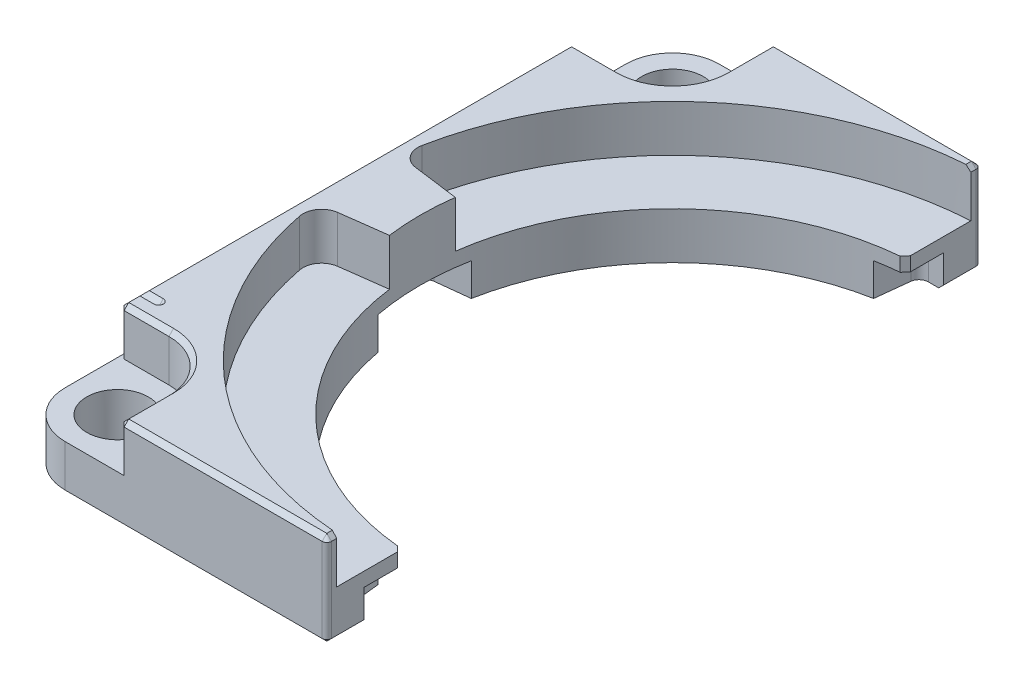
ISO-10303-21;
HEADER;
FILE_DESCRIPTION(('STEP AP214'),'2;1');
FILE_NAME('part.step','',(''),(''),'','','');
FILE_SCHEMA(('AUTOMOTIVE_DESIGN { 1 0 10303 214 1 1 1 1 }'));
ENDSEC;
DATA;
#1=APPLICATION_CONTEXT('core data for automotive mechanical design processes');
#2=APPLICATION_PROTOCOL_DEFINITION('international standard','automotive_design',2000,#1);
#3=PRODUCT_CONTEXT('',#1,'mechanical');
#4=PRODUCT('Part','Part','',(#3));
#5=PRODUCT_RELATED_PRODUCT_CATEGORY('part','',(#4));
#6=PRODUCT_DEFINITION_FORMATION('','',#4);
#7=PRODUCT_DEFINITION_CONTEXT('part definition',#1,'design');
#8=PRODUCT_DEFINITION('design','',#6,#7);
#9=PRODUCT_DEFINITION_SHAPE('','',#8);
#10=(LENGTH_UNIT() NAMED_UNIT(*) SI_UNIT(.MILLI.,.METRE.));
#11=(NAMED_UNIT(*) PLANE_ANGLE_UNIT() SI_UNIT($,.RADIAN.));
#12=(NAMED_UNIT(*) SI_UNIT($,.STERADIAN.) SOLID_ANGLE_UNIT());
#13=UNCERTAINTY_MEASURE_WITH_UNIT(LENGTH_MEASURE(1.E-05),#10,'distance_accuracy_value','');
#14=(GEOMETRIC_REPRESENTATION_CONTEXT(3) GLOBAL_UNCERTAINTY_ASSIGNED_CONTEXT((#13)) GLOBAL_UNIT_ASSIGNED_CONTEXT((#10,
#11,#12)) REPRESENTATION_CONTEXT('',''));
#15=CARTESIAN_POINT('',(0.,0.,0.));
#16=DIRECTION('',(0.,0.,1.));
#17=DIRECTION('',(1.,0.,0.));
#18=AXIS2_PLACEMENT_3D('',#15,#16,#17);
#19=CARTESIAN_POINT('',(-34.5,10.,30.));
#20=DIRECTION('',(0.707106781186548,-0.707106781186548,0.));
#21=DIRECTION('',(0.,0.,1.));
#22=AXIS2_PLACEMENT_3D('',#19,#20,#21);
#23=PLANE('',#22);
#24=DIRECTION('',(-0.577350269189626,-0.577350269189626,-0.577350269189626));
#25=VECTOR('',#24,1.);
#26=CARTESIAN_POINT('',(-32.,12.5,25.));
#27=LINE('',#26,#25);
#28=CARTESIAN_POINT('',(-35.,9.5,22.));
#29=VERTEX_POINT('',#28);
#30=CARTESIAN_POINT('',(-34.5,10.,22.5));
#31=VERTEX_POINT('',#30);
#32=EDGE_CURVE('E11',#29,#31,#27,.F.);
#33=ORIENTED_EDGE('',*,*,#32,.F.);
#34=DIRECTION('',(0.,0.,-1.));
#35=VECTOR('',#34,1.);
#36=CARTESIAN_POINT('',(-35.,9.5,-30.));
#37=LINE('',#36,#35);
#38=CARTESIAN_POINT('',(-35.,9.5,23.7));
#39=VERTEX_POINT('',#38);
#40=EDGE_CURVE('E714',#39,#29,#37,.T.);
#41=ORIENTED_EDGE('',*,*,#40,.F.);
#42=DIRECTION('',(0.707106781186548,0.707106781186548,0.));
#43=VECTOR('',#42,1.);
#44=CARTESIAN_POINT('',(-35.,9.5,23.7));
#45=LINE('',#44,#43);
#46=CARTESIAN_POINT('',(-34.5,10.,23.7));
#47=VERTEX_POINT('',#46);
#48=EDGE_CURVE('E820',#39,#47,#45,.T.);
#49=ORIENTED_EDGE('',*,*,#48,.T.);
#50=DIRECTION('',(0.,0.,1.));
#51=VECTOR('',#50,1.);
#52=CARTESIAN_POINT('',(-34.5,10.,30.));
#53=LINE('',#52,#51);
#54=EDGE_CURVE('E663',#31,#47,#53,.T.);
#55=ORIENTED_EDGE('',*,*,#54,.F.);
#56=EDGE_LOOP('',(#33,#41,#49,#55));
#57=FACE_BOUND('',#56,.T.);
#58=ADVANCED_FACE('F17',(#57),#23,.F.);
#59=CARTESIAN_POINT('',(-30.,10.,30.));
#60=DIRECTION('',(0.,-1.,0.));
#61=DIRECTION('',(0.,0.,-1.));
#62=AXIS2_PLACEMENT_3D('',#59,#60,#61);
#63=PLANE('',#62);
#64=DIRECTION('',(-1.,0.,0.));
#65=VECTOR('',#64,1.);
#66=CARTESIAN_POINT('',(-33.,10.,21.5));
#67=LINE('',#66,#65);
#68=CARTESIAN_POINT('',(-33.,10.,21.5));
#69=VERTEX_POINT('',#68);
#70=CARTESIAN_POINT('',(-34.5,10.,21.5));
#71=VERTEX_POINT('',#70);
#72=EDGE_CURVE('E33',#69,#71,#67,.T.);
#73=ORIENTED_EDGE('',*,*,#72,.F.);
#74=CARTESIAN_POINT('',(-33.,10.,22.));
#75=DIRECTION('',(0.,-1.,0.));
#76=DIRECTION('',(0.,0.,-1.));
#77=AXIS2_PLACEMENT_3D('',#74,#75,#76);
#78=CIRCLE('',#77,0.500000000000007);
#79=CARTESIAN_POINT('',(-33.,10.,22.5));
#80=VERTEX_POINT('',#79);
#81=EDGE_CURVE('E388',#69,#80,#78,.T.);
#82=ORIENTED_EDGE('',*,*,#81,.T.);
#83=DIRECTION('',(-1.,0.,0.));
#84=VECTOR('',#83,1.);
#85=CARTESIAN_POINT('',(-33.,10.,22.5));
#86=LINE('',#85,#84);
#87=EDGE_CURVE('E407',#80,#31,#86,.T.);
#88=ORIENTED_EDGE('',*,*,#87,.T.);
#89=ORIENTED_EDGE('',*,*,#54,.T.);
#90=DIRECTION('',(1.,0.,0.));
#91=VECTOR('',#90,1.);
#92=CARTESIAN_POINT('',(-29.7,10.,23.7));
#93=LINE('',#92,#91);
#94=CARTESIAN_POINT('',(-29.7,10.,23.7));
#95=VERTEX_POINT('',#94);
#96=EDGE_CURVE('E661',#47,#95,#93,.T.);
#97=ORIENTED_EDGE('',*,*,#96,.T.);
#98=CARTESIAN_POINT('',(-29.7,10.,29.7));
#99=DIRECTION('',(0.,-1.,0.));
#100=DIRECTION('',(0.,0.,-1.));
#101=AXIS2_PLACEMENT_3D('',#98,#99,#100);
#102=CIRCLE('',#101,6.);
#103=CARTESIAN_POINT('',(-23.7,10.,29.7));
#104=VERTEX_POINT('',#103);
#105=EDGE_CURVE('E659',#95,#104,#102,.T.);
#106=ORIENTED_EDGE('',*,*,#105,.T.);
#107=DIRECTION('',(0.,0.,1.));
#108=VECTOR('',#107,1.);
#109=CARTESIAN_POINT('',(-23.7,10.,35.));
#110=LINE('',#109,#108);
#111=CARTESIAN_POINT('',(-23.7,10.,34.5));
#112=VERTEX_POINT('',#111);
#113=EDGE_CURVE('E657',#104,#112,#110,.T.);
#114=ORIENTED_EDGE('',*,*,#113,.T.);
#115=DIRECTION('',(1.,0.,0.));
#116=VECTOR('',#115,1.);
#117=CARTESIAN_POINT('',(-30.,10.,34.5));
#118=LINE('',#117,#116);
#119=CARTESIAN_POINT('',(-2.5,10.,34.5));
#120=VERTEX_POINT('',#119);
#121=EDGE_CURVE('E653',#112,#120,#118,.T.);
#122=ORIENTED_EDGE('',*,*,#121,.T.);
#123=DIRECTION('',(0.,0.,-1.));
#124=VECTOR('',#123,1.);
#125=CARTESIAN_POINT('',(-2.5,10.,30.));
#126=LINE('',#125,#124);
#127=CARTESIAN_POINT('',(-2.5,10.,33.9079636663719));
#128=VERTEX_POINT('',#127);
#129=EDGE_CURVE('E655',#120,#128,#126,.T.);
#130=ORIENTED_EDGE('',*,*,#129,.T.);
#131=CARTESIAN_POINT('',(0.,10.,0.));
#132=DIRECTION('',(0.,1.,0.));
#133=DIRECTION('',(0.,0.,1.));
#134=AXIS2_PLACEMENT_3D('',#131,#132,#133);
#135=CIRCLE('',#134,34.);
#136=CARTESIAN_POINT('',(-33.3658545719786,10.,6.53603462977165));
#137=VERTEX_POINT('',#136);
#138=EDGE_CURVE('E448',#137,#128,#135,.T.);
#139=ORIENTED_EDGE('',*,*,#138,.F.);
#140=CARTESIAN_POINT('',(-31.4031572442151,10.,6.15156200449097));
#141=DIRECTION('',(0.,1.,0.));
#142=DIRECTION('',(0.,0.,1.));
#143=AXIS2_PLACEMENT_3D('',#140,#141,#142);
#144=CIRCLE('',#143,2.);
#145=CARTESIAN_POINT('',(-31.6642096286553,10.,4.16867228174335));
#146=VERTEX_POINT('',#145);
#147=EDGE_CURVE('E445',#146,#137,#144,.T.);
#148=ORIENTED_EDGE('',*,*,#147,.F.);
#149=DIRECTION('',(-0.99144486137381,0.,0.130526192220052));
#150=VECTOR('',#149,1.);
#151=CARTESIAN_POINT('',(-26.7690112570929,10.,3.5242071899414));
#152=LINE('',#151,#150);
#153=CARTESIAN_POINT('',(-26.7690112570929,10.,3.5242071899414));
#154=VERTEX_POINT('',#153);
#155=EDGE_CURVE('E443',#154,#146,#152,.T.);
#156=ORIENTED_EDGE('',*,*,#155,.F.);
#157=CARTESIAN_POINT('',(0.,10.,0.));
#158=DIRECTION('',(0.,-1.,0.));
#159=DIRECTION('',(0.,0.,1.));
#160=AXIS2_PLACEMENT_3D('',#157,#158,#159);
#161=CIRCLE('',#160,27.);
#162=CARTESIAN_POINT('',(-26.7690112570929,10.,-3.5242071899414));
#163=VERTEX_POINT('',#162);
#164=EDGE_CURVE('E614',#154,#163,#161,.T.);
#165=ORIENTED_EDGE('',*,*,#164,.T.);
#166=DIRECTION('',(0.99144486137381,0.,0.130526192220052));
#167=VECTOR('',#166,1.);
#168=CARTESIAN_POINT('',(-26.7690112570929,10.,-3.5242071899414));
#169=LINE('',#168,#167);
#170=CARTESIAN_POINT('',(-31.6642096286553,10.,-4.16867228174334));
#171=VERTEX_POINT('',#170);
#172=EDGE_CURVE('E417',#171,#163,#169,.T.);
#173=ORIENTED_EDGE('',*,*,#172,.F.);
#174=CARTESIAN_POINT('',(-31.4031572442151,10.,-6.15156200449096));
#175=DIRECTION('',(0.,1.,0.));
#176=DIRECTION('',(0.,0.,-1.));
#177=AXIS2_PLACEMENT_3D('',#174,#175,#176);
#178=CIRCLE('',#177,2.);
#179=CARTESIAN_POINT('',(-33.3658545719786,10.,-6.53603462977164));
#180=VERTEX_POINT('',#179);
#181=EDGE_CURVE('E414',#180,#171,#178,.T.);
#182=ORIENTED_EDGE('',*,*,#181,.F.);
#183=CARTESIAN_POINT('',(0.,10.,0.));
#184=DIRECTION('',(0.,1.,0.));
#185=DIRECTION('',(0.,0.,1.));
#186=AXIS2_PLACEMENT_3D('',#183,#184,#185);
#187=CIRCLE('',#186,34.);
#188=CARTESIAN_POINT('',(-2.5,10.,-33.9079636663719));
#189=VERTEX_POINT('',#188);
#190=EDGE_CURVE('E412',#189,#180,#187,.T.);
#191=ORIENTED_EDGE('',*,*,#190,.F.);
#192=DIRECTION('',(0.,0.,-1.));
#193=VECTOR('',#192,1.);
#194=CARTESIAN_POINT('',(-2.5,10.,30.));
#195=LINE('',#194,#193);
#196=CARTESIAN_POINT('',(-2.5,10.,-34.5));
#197=VERTEX_POINT('',#196);
#198=EDGE_CURVE('E673',#189,#197,#195,.T.);
#199=ORIENTED_EDGE('',*,*,#198,.T.);
#200=DIRECTION('',(-1.,0.,0.));
#201=VECTOR('',#200,1.);
#202=CARTESIAN_POINT('',(-30.,10.,-34.5));
#203=LINE('',#202,#201);
#204=CARTESIAN_POINT('',(-23.7,10.,-34.5));
#205=VERTEX_POINT('',#204);
#206=EDGE_CURVE('E671',#197,#205,#203,.T.);
#207=ORIENTED_EDGE('',*,*,#206,.T.);
#208=DIRECTION('',(0.,0.,1.));
#209=VECTOR('',#208,1.);
#210=CARTESIAN_POINT('',(-23.7,10.,-29.7));
#211=LINE('',#210,#209);
#212=CARTESIAN_POINT('',(-23.7,10.,-29.7));
#213=VERTEX_POINT('',#212);
#214=EDGE_CURVE('E669',#205,#213,#211,.T.);
#215=ORIENTED_EDGE('',*,*,#214,.T.);
#216=CARTESIAN_POINT('',(-29.7,10.,-29.7));
#217=DIRECTION('',(0.,-1.,0.));
#218=DIRECTION('',(0.,0.,-1.));
#219=AXIS2_PLACEMENT_3D('',#216,#217,#218);
#220=CIRCLE('',#219,6.);
#221=CARTESIAN_POINT('',(-29.7,10.,-23.7));
#222=VERTEX_POINT('',#221);
#223=EDGE_CURVE('E667',#213,#222,#220,.T.);
#224=ORIENTED_EDGE('',*,*,#223,.T.);
#225=DIRECTION('',(-1.,0.,0.));
#226=VECTOR('',#225,1.);
#227=CARTESIAN_POINT('',(-35.,10.,-23.7));
#228=LINE('',#227,#226);
#229=CARTESIAN_POINT('',(-34.5,10.,-23.7));
#230=VERTEX_POINT('',#229);
#231=EDGE_CURVE('E665',#222,#230,#228,.T.);
#232=ORIENTED_EDGE('',*,*,#231,.T.);
#233=EDGE_CURVE('E405',#230,#71,#53,.T.);
#234=ORIENTED_EDGE('',*,*,#233,.T.);
#235=EDGE_LOOP('',(#73,#82,#88,#89,#97,#106,#114,#122,#130,#139,#148,#156,#165,#173,#182,#191,
#199,#207,#215,#224,#232,#234));
#236=FACE_BOUND('',#235,.T.);
#237=ADVANCED_FACE('F403',(#236),#63,.F.);
#238=CARTESIAN_POINT('',(-2.,10.,35.));
#239=DIRECTION('',(-1.,0.,0.));
#240=DIRECTION('',(0.,0.,1.));
#241=AXIS2_PLACEMENT_3D('',#238,#239,#240);
#242=PLANE('',#241);
#243=DIRECTION('',(0.,0.,-1.));
#244=VECTOR('',#243,1.);
#245=CARTESIAN_POINT('',(-2.,3.5,35.));
#246=LINE('',#245,#244);
#247=CARTESIAN_POINT('',(-2.,3.5,31.));
#248=VERTEX_POINT('',#247);
#249=CARTESIAN_POINT('',(-2.,3.5,27.4258240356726));
#250=VERTEX_POINT('',#249);
#251=EDGE_CURVE('E610',#248,#250,#246,.T.);
#252=ORIENTED_EDGE('',*,*,#251,.T.);
#253=DIRECTION('',(0.,1.,0.));
#254=VECTOR('',#253,1.);
#255=CARTESIAN_POINT('',(-2.,10.,27.4258240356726));
#256=LINE('',#255,#254);
#257=CARTESIAN_POINT('',(-2.,5.,27.4258240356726));
#258=VERTEX_POINT('',#257);
#259=EDGE_CURVE('E738',#250,#258,#256,.T.);
#260=ORIENTED_EDGE('',*,*,#259,.T.);
#261=DIRECTION('',(0.,0.,-1.));
#262=VECTOR('',#261,1.);
#263=CARTESIAN_POINT('',(-2.,5.,26.9258240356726));
#264=LINE('',#263,#262);
#265=CARTESIAN_POINT('',(-2.,5.,33.9411254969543));
#266=VERTEX_POINT('',#265);
#267=EDGE_CURVE('E446',#266,#258,#264,.T.);
#268=ORIENTED_EDGE('',*,*,#267,.F.);
#269=DIRECTION('',(0.,-1.,0.));
#270=VECTOR('',#269,1.);
#271=CARTESIAN_POINT('',(-2.,10.,33.9411254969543));
#272=LINE('',#271,#270);
#273=CARTESIAN_POINT('',(-2.,9.5,33.9411254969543));
#274=VERTEX_POINT('',#273);
#275=EDGE_CURVE('E451',#274,#266,#272,.T.);
#276=ORIENTED_EDGE('',*,*,#275,.F.);
#277=DIRECTION('',(0.,0.,1.));
#278=VECTOR('',#277,1.);
#279=CARTESIAN_POINT('',(-2.,9.5,35.));
#280=LINE('',#279,#278);
#281=CARTESIAN_POINT('',(-2.,9.5,34.5));
#282=VERTEX_POINT('',#281);
#283=EDGE_CURVE('E736',#274,#282,#280,.T.);
#284=ORIENTED_EDGE('',*,*,#283,.T.);
#285=DIRECTION('',(0.,-1.,0.));
#286=VECTOR('',#285,1.);
#287=CARTESIAN_POINT('',(-2.,10.,34.5));
#288=LINE('',#287,#286);
#289=CARTESIAN_POINT('',(-2.,0.5,34.5));
#290=VERTEX_POINT('',#289);
#291=EDGE_CURVE('E637',#282,#290,#288,.T.);
#292=ORIENTED_EDGE('',*,*,#291,.T.);
#293=DIRECTION('',(0.,0.,-1.));
#294=VECTOR('',#293,1.);
#295=CARTESIAN_POINT('',(-2.,0.5,31.));
#296=LINE('',#295,#294);
#297=CARTESIAN_POINT('',(-2.,0.5,31.));
#298=VERTEX_POINT('',#297);
#299=EDGE_CURVE('E733',#290,#298,#296,.T.);
#300=ORIENTED_EDGE('',*,*,#299,.T.);
#301=DIRECTION('',(0.,-1.,0.));
#302=VECTOR('',#301,1.);
#303=CARTESIAN_POINT('',(-2.,10.,31.));
#304=LINE('',#303,#302);
#305=EDGE_CURVE('E560',#248,#298,#304,.T.);
#306=ORIENTED_EDGE('',*,*,#305,.F.);
#307=EDGE_LOOP('',(#252,#260,#268,#276,#284,#292,#300,#306));
#308=FACE_BOUND('',#307,.T.);
#309=ADVANCED_FACE('F1070',(#308),#242,.F.);
#310=CARTESIAN_POINT('',(0.,10.,0.));
#311=DIRECTION('',(0.,-1.,0.));
#312=DIRECTION('',(0.,0.,-1.));
#313=AXIS2_PLACEMENT_3D('',#310,#311,#312);
#314=CYLINDRICAL_SURFACE('',#313,27.);
#315=CARTESIAN_POINT('',(0.,5.,0.));
#316=DIRECTION('',(0.,-1.,0.));
#317=DIRECTION('',(0.,0.,1.));
#318=AXIS2_PLACEMENT_3D('',#315,#316,#317);
#319=CIRCLE('',#318,27.);
#320=CARTESIAN_POINT('',(-2.54614498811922,5.,26.8796790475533));
#321=VERTEX_POINT('',#320);
#322=CARTESIAN_POINT('',(-26.7690112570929,5.,3.5242071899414));
#323=VERTEX_POINT('',#322);
#324=EDGE_CURVE('E452',#321,#323,#319,.T.);
#325=ORIENTED_EDGE('',*,*,#324,.F.);
#326=DIRECTION('',(0.,-1.,0.));
#327=VECTOR('',#326,1.);
#328=CARTESIAN_POINT('',(-2.54614498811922,10.,26.8796790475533));
#329=LINE('',#328,#327);
#330=CARTESIAN_POINT('',(-2.54614498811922,3.5,26.8796790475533));
#331=VERTEX_POINT('',#330);
#332=EDGE_CURVE('E728',#321,#331,#329,.T.);
#333=ORIENTED_EDGE('',*,*,#332,.T.);
#334=CARTESIAN_POINT('',(0.,3.5,0.));
#335=DIRECTION('',(0.,-1.,0.));
#336=DIRECTION('',(0.,0.,1.));
#337=AXIS2_PLACEMENT_3D('',#334,#335,#336);
#338=CIRCLE('',#337,27.);
#339=CARTESIAN_POINT('',(-5.00000000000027,3.5,26.5329983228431));
#340=VERTEX_POINT('',#339);
#341=EDGE_CURVE('E583',#331,#340,#338,.T.);
#342=ORIENTED_EDGE('',*,*,#341,.T.);
#343=DIRECTION('',(0.,-1.,0.));
#344=VECTOR('',#343,1.);
#345=CARTESIAN_POINT('',(-5.00000000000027,3.5,26.5329983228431));
#346=LINE('',#345,#344);
#347=CARTESIAN_POINT('',(-5.00000000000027,0.,26.5329983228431));
#348=VERTEX_POINT('',#347);
#349=EDGE_CURVE('E575',#340,#348,#346,.T.);
#350=ORIENTED_EDGE('',*,*,#349,.T.);
#351=CARTESIAN_POINT('',(0.,0.,0.));
#352=DIRECTION('',(0.,-1.,0.));
#353=DIRECTION('',(0.,0.,1.));
#354=AXIS2_PLACEMENT_3D('',#351,#352,#353);
#355=CIRCLE('',#354,27.);
#356=CARTESIAN_POINT('',(-26.5329983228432,0.,5.));
#357=VERTEX_POINT('',#356);
#358=EDGE_CURVE('E618',#348,#357,#355,.T.);
#359=ORIENTED_EDGE('',*,*,#358,.T.);
#360=DIRECTION('',(0.,-1.,0.));
#361=VECTOR('',#360,1.);
#362=CARTESIAN_POINT('',(-26.5329983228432,3.5,5.));
#363=LINE('',#362,#361);
#364=CARTESIAN_POINT('',(-26.5329983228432,3.5,5.));
#365=VERTEX_POINT('',#364);
#366=EDGE_CURVE('E532',#365,#357,#363,.T.);
#367=ORIENTED_EDGE('',*,*,#366,.F.);
#368=CARTESIAN_POINT('',(0.,3.5,0.));
#369=DIRECTION('',(0.,-1.,0.));
#370=DIRECTION('',(0.,0.,1.));
#371=AXIS2_PLACEMENT_3D('',#368,#369,#370);
#372=CIRCLE('',#371,27.);
#373=CARTESIAN_POINT('',(-26.5329983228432,3.5,-5.));
#374=VERTEX_POINT('',#373);
#375=EDGE_CURVE('E518',#365,#374,#372,.T.);
#376=ORIENTED_EDGE('',*,*,#375,.T.);
#377=DIRECTION('',(0.,-1.,0.));
#378=VECTOR('',#377,1.);
#379=CARTESIAN_POINT('',(-26.5329983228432,3.5,-5.));
#380=LINE('',#379,#378);
#381=CARTESIAN_POINT('',(-26.5329983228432,0.,-5.));
#382=VERTEX_POINT('',#381);
#383=EDGE_CURVE('E557',#374,#382,#380,.T.);
#384=ORIENTED_EDGE('',*,*,#383,.T.);
#385=CARTESIAN_POINT('',(-4.99999999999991,0.,-26.5329983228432));
#386=VERTEX_POINT('',#385);
#387=EDGE_CURVE('E613',#382,#386,#355,.T.);
#388=ORIENTED_EDGE('',*,*,#387,.T.);
#389=DIRECTION('',(0.,-1.,0.));
#390=VECTOR('',#389,1.);
#391=CARTESIAN_POINT('',(-4.99999999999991,3.5,-26.5329983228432));
#392=LINE('',#391,#390);
#393=CARTESIAN_POINT('',(-4.99999999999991,3.5,-26.5329983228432));
#394=VERTEX_POINT('',#393);
#395=EDGE_CURVE('E571',#394,#386,#392,.T.);
#396=ORIENTED_EDGE('',*,*,#395,.F.);
#397=CARTESIAN_POINT('',(0.,3.5,0.));
#398=DIRECTION('',(0.,-1.,0.));
#399=DIRECTION('',(0.,0.,1.));
#400=AXIS2_PLACEMENT_3D('',#397,#398,#399);
#401=CIRCLE('',#400,27.);
#402=CARTESIAN_POINT('',(-2.50298176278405,3.5,-26.8837326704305));
#403=VERTEX_POINT('',#402);
#404=EDGE_CURVE('E561',#394,#403,#401,.T.);
#405=ORIENTED_EDGE('',*,*,#404,.T.);
#406=DIRECTION('',(0.,-1.,0.));
#407=VECTOR('',#406,1.);
#408=CARTESIAN_POINT('',(-2.50298176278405,10.,-26.8837326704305));
#409=LINE('',#408,#407);
#410=CARTESIAN_POINT('',(-2.50298176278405,5.,-26.8837326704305));
#411=VERTEX_POINT('',#410);
#412=EDGE_CURVE('E726',#403,#411,#409,.F.);
#413=ORIENTED_EDGE('',*,*,#412,.T.);
#414=CARTESIAN_POINT('',(0.,5.,0.));
#415=DIRECTION('',(0.,-1.,0.));
#416=DIRECTION('',(0.,0.,1.));
#417=AXIS2_PLACEMENT_3D('',#414,#415,#416);
#418=CIRCLE('',#417,27.);
#419=CARTESIAN_POINT('',(-26.7690112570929,5.,-3.5242071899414));
#420=VERTEX_POINT('',#419);
#421=EDGE_CURVE('E420',#420,#411,#418,.T.);
#422=ORIENTED_EDGE('',*,*,#421,.F.);
#423=DIRECTION('',(0.,-1.,0.));
#424=VECTOR('',#423,1.);
#425=CARTESIAN_POINT('',(-26.7690112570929,10.,-3.5242071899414));
#426=LINE('',#425,#424);
#427=EDGE_CURVE('E419',#163,#420,#426,.T.);
#428=ORIENTED_EDGE('',*,*,#427,.F.);
#429=ORIENTED_EDGE('',*,*,#164,.F.);
#430=DIRECTION('',(0.,-1.,0.));
#431=VECTOR('',#430,1.);
#432=CARTESIAN_POINT('',(-26.7690112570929,10.,3.5242071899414));
#433=LINE('',#432,#431);
#434=EDGE_CURVE('E424',#154,#323,#433,.T.);
#435=ORIENTED_EDGE('',*,*,#434,.T.);
#436=EDGE_LOOP('',(#325,#333,#342,#350,#359,#367,#376,#384,#388,#396,#405,#413,#422,#428,#429,#435));
#437=FACE_BOUND('',#436,.T.);
#438=ADVANCED_FACE('F958',(#437),#314,.F.);
#439=CARTESIAN_POINT('',(-2.,10.,-35.));
#440=DIRECTION('',(-1.,0.,0.));
#441=DIRECTION('',(0.,0.,1.));
#442=AXIS2_PLACEMENT_3D('',#439,#440,#441);
#443=PLANE('',#442);
#444=DIRECTION('',(0.,-1.,0.));
#445=VECTOR('',#444,1.);
#446=CARTESIAN_POINT('',(-2.,10.,-34.5));
#447=LINE('',#446,#445);
#448=CARTESIAN_POINT('',(-2.,0.5,-34.5));
#449=VERTEX_POINT('',#448);
#450=CARTESIAN_POINT('',(-2.,9.5,-34.5));
#451=VERTEX_POINT('',#450);
#452=EDGE_CURVE('E650',#449,#451,#447,.F.);
#453=ORIENTED_EDGE('',*,*,#452,.T.);
#454=DIRECTION('',(0.,0.,1.));
#455=VECTOR('',#454,1.);
#456=CARTESIAN_POINT('',(-2.,9.5,-35.));
#457=LINE('',#456,#455);
#458=CARTESIAN_POINT('',(-2.,9.5,-33.9411254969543));
#459=VERTEX_POINT('',#458);
#460=EDGE_CURVE('E681',#451,#459,#457,.T.);
#461=ORIENTED_EDGE('',*,*,#460,.T.);
#462=DIRECTION('',(0.,-1.,0.));
#463=VECTOR('',#462,1.);
#464=CARTESIAN_POINT('',(-2.,10.,-33.9411254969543));
#465=LINE('',#464,#463);
#466=CARTESIAN_POINT('',(-2.,5.,-33.9411254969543));
#467=VERTEX_POINT('',#466);
#468=EDGE_CURVE('E439',#459,#467,#465,.T.);
#469=ORIENTED_EDGE('',*,*,#468,.T.);
#470=DIRECTION('',(0.,0.,-1.));
#471=VECTOR('',#470,1.);
#472=CARTESIAN_POINT('',(-2.,5.,-26.9258240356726));
#473=LINE('',#472,#471);
#474=CARTESIAN_POINT('',(-2.,5.,-27.4674310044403));
#475=VERTEX_POINT('',#474);
#476=EDGE_CURVE('E423',#475,#467,#473,.T.);
#477=ORIENTED_EDGE('',*,*,#476,.F.);
#478=DIRECTION('',(0.,-1.,0.));
#479=VECTOR('',#478,1.);
#480=CARTESIAN_POINT('',(-2.,10.,-27.4674310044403));
#481=LINE('',#480,#479);
#482=CARTESIAN_POINT('',(-2.,3.5,-27.4674310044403));
#483=VERTEX_POINT('',#482);
#484=EDGE_CURVE('E678',#475,#483,#481,.T.);
#485=ORIENTED_EDGE('',*,*,#484,.T.);
#486=DIRECTION('',(0.,0.,-1.));
#487=VECTOR('',#486,1.);
#488=CARTESIAN_POINT('',(-2.,3.5,-35.));
#489=LINE('',#488,#487);
#490=CARTESIAN_POINT('',(-2.,3.5,-31.));
#491=VERTEX_POINT('',#490);
#492=EDGE_CURVE('E634',#483,#491,#489,.T.);
#493=ORIENTED_EDGE('',*,*,#492,.T.);
#494=DIRECTION('',(0.,1.,0.));
#495=VECTOR('',#494,1.);
#496=CARTESIAN_POINT('',(-2.,10.,-31.));
#497=LINE('',#496,#495);
#498=CARTESIAN_POINT('',(-2.,0.5,-31.));
#499=VERTEX_POINT('',#498);
#500=EDGE_CURVE('E608',#499,#491,#497,.T.);
#501=ORIENTED_EDGE('',*,*,#500,.F.);
#502=DIRECTION('',(0.,0.,-1.));
#503=VECTOR('',#502,1.);
#504=CARTESIAN_POINT('',(-2.,0.5,-34.5));
#505=LINE('',#504,#503);
#506=EDGE_CURVE('E676',#499,#449,#505,.T.);
#507=ORIENTED_EDGE('',*,*,#506,.T.);
#508=EDGE_LOOP('',(#453,#461,#469,#477,#485,#493,#501,#507));
#509=FACE_BOUND('',#508,.T.);
#510=ADVANCED_FACE('F1368',(#509),#443,.F.);
#511=CARTESIAN_POINT('',(-2.,10.,35.));
#512=DIRECTION('',(0.,0.,-1.));
#513=DIRECTION('',(-1.,0.,0.));
#514=AXIS2_PLACEMENT_3D('',#511,#512,#513);
#515=PLANE('',#514);
#516=DIRECTION('',(0.,-1.,0.));
#517=VECTOR('',#516,1.);
#518=CARTESIAN_POINT('',(-30.,10.,35.));
#519=LINE('',#518,#517);
#520=CARTESIAN_POINT('',(-30.,5.,35.));
#521=VERTEX_POINT('',#520);
#522=CARTESIAN_POINT('',(-30.,0.5,35.));
#523=VERTEX_POINT('',#522);
#524=EDGE_CURVE('E617',#521,#523,#519,.T.);
#525=ORIENTED_EDGE('',*,*,#524,.T.);
#526=DIRECTION('',(1.,0.,0.));
#527=VECTOR('',#526,1.);
#528=CARTESIAN_POINT('',(-2.5,0.5,35.));
#529=LINE('',#528,#527);
#530=CARTESIAN_POINT('',(-2.5,0.5,35.));
#531=VERTEX_POINT('',#530);
#532=EDGE_CURVE('E778',#523,#531,#529,.T.);
#533=ORIENTED_EDGE('',*,*,#532,.T.);
#534=DIRECTION('',(0.,-1.,0.));
#535=VECTOR('',#534,1.);
#536=CARTESIAN_POINT('',(-2.5,10.,35.));
#537=LINE('',#536,#535);
#538=CARTESIAN_POINT('',(-2.5,9.5,35.));
#539=VERTEX_POINT('',#538);
#540=EDGE_CURVE('E644',#531,#539,#537,.F.);
#541=ORIENTED_EDGE('',*,*,#540,.T.);
#542=DIRECTION('',(-1.,0.,0.));
#543=VECTOR('',#542,1.);
#544=CARTESIAN_POINT('',(-2.,9.5,35.));
#545=LINE('',#544,#543);
#546=CARTESIAN_POINT('',(-23.7,9.5,35.));
#547=VERTEX_POINT('',#546);
#548=EDGE_CURVE('E774',#539,#547,#545,.T.);
#549=ORIENTED_EDGE('',*,*,#548,.T.);
#550=DIRECTION('',(0.,-1.,0.));
#551=VECTOR('',#550,1.);
#552=CARTESIAN_POINT('',(-23.7,5.,35.));
#553=LINE('',#552,#551);
#554=CARTESIAN_POINT('',(-23.7,5.,35.));
#555=VERTEX_POINT('',#554);
#556=EDGE_CURVE('E776',#547,#555,#553,.T.);
#557=ORIENTED_EDGE('',*,*,#556,.T.);
#558=DIRECTION('',(1.,0.,0.));
#559=VECTOR('',#558,1.);
#560=CARTESIAN_POINT('',(-24.2,5.,35.));
#561=LINE('',#560,#559);
#562=EDGE_CURVE('E41',#521,#555,#561,.T.);
#563=ORIENTED_EDGE('',*,*,#562,.F.);
#564=EDGE_LOOP('',(#525,#533,#541,#549,#557,#563));
#565=FACE_BOUND('',#564,.T.);
#566=ADVANCED_FACE('F926',(#565),#515,.F.);
#567=CARTESIAN_POINT('',(-2.,10.,-35.));
#568=DIRECTION('',(0.,0.,1.));
#569=DIRECTION('',(1.,0.,0.));
#570=AXIS2_PLACEMENT_3D('',#567,#568,#569);
#571=PLANE('',#570);
#572=DIRECTION('',(-1.,0.,0.));
#573=VECTOR('',#572,1.);
#574=CARTESIAN_POINT('',(-24.2,5.,-35.));
#575=LINE('',#574,#573);
#576=CARTESIAN_POINT('',(-23.7,5.,-35.));
#577=VERTEX_POINT('',#576);
#578=CARTESIAN_POINT('',(-30.,5.,-35.));
#579=VERTEX_POINT('',#578);
#580=EDGE_CURVE('E487',#577,#579,#575,.T.);
#581=ORIENTED_EDGE('',*,*,#580,.F.);
#582=DIRECTION('',(0.,1.,0.));
#583=VECTOR('',#582,1.);
#584=CARTESIAN_POINT('',(-23.7,10.,-35.));
#585=LINE('',#584,#583);
#586=CARTESIAN_POINT('',(-23.7,9.5,-35.));
#587=VERTEX_POINT('',#586);
#588=EDGE_CURVE('E703',#577,#587,#585,.T.);
#589=ORIENTED_EDGE('',*,*,#588,.T.);
#590=DIRECTION('',(1.,0.,0.));
#591=VECTOR('',#590,1.);
#592=CARTESIAN_POINT('',(-2.,9.5,-35.));
#593=LINE('',#592,#591);
#594=CARTESIAN_POINT('',(-2.5,9.5,-35.));
#595=VERTEX_POINT('',#594);
#596=EDGE_CURVE('E701',#587,#595,#593,.T.);
#597=ORIENTED_EDGE('',*,*,#596,.T.);
#598=DIRECTION('',(0.,-1.,0.));
#599=VECTOR('',#598,1.);
#600=CARTESIAN_POINT('',(-2.5,10.,-35.));
#601=LINE('',#600,#599);
#602=CARTESIAN_POINT('',(-2.5,0.5,-35.));
#603=VERTEX_POINT('',#602);
#604=EDGE_CURVE('E647',#595,#603,#601,.T.);
#605=ORIENTED_EDGE('',*,*,#604,.T.);
#606=DIRECTION('',(-1.,0.,0.));
#607=VECTOR('',#606,1.);
#608=CARTESIAN_POINT('',(-30.,0.5,-35.));
#609=LINE('',#608,#607);
#610=CARTESIAN_POINT('',(-30.,0.5,-35.));
#611=VERTEX_POINT('',#610);
#612=EDGE_CURVE('E699',#603,#611,#609,.T.);
#613=ORIENTED_EDGE('',*,*,#612,.T.);
#614=DIRECTION('',(0.,-1.,0.));
#615=VECTOR('',#614,1.);
#616=CARTESIAN_POINT('',(-30.,10.,-35.));
#617=LINE('',#616,#615);
#618=EDGE_CURVE('E629',#579,#611,#617,.T.);
#619=ORIENTED_EDGE('',*,*,#618,.F.);
#620=EDGE_LOOP('',(#581,#589,#597,#605,#613,#619));
#621=FACE_BOUND('',#620,.T.);
#622=ADVANCED_FACE('F999',(#621),#571,.F.);
#623=CARTESIAN_POINT('',(-30.,10.,-30.));
#624=DIRECTION('',(0.,-1.,0.));
#625=DIRECTION('',(0.,0.,-1.));
#626=AXIS2_PLACEMENT_3D('',#623,#624,#625);
#627=CYLINDRICAL_SURFACE('',#626,5.);
#628=ORIENTED_EDGE('',*,*,#618,.T.);
#629=CARTESIAN_POINT('',(-30.,0.5,-30.));
#630=DIRECTION('',(0.,-1.,0.));
#631=DIRECTION('',(0.,0.,-1.));
#632=AXIS2_PLACEMENT_3D('',#629,#630,#631);
#633=CIRCLE('',#632,5.);
#634=CARTESIAN_POINT('',(-35.,0.5,-30.));
#635=VERTEX_POINT('',#634);
#636=EDGE_CURVE('E766',#611,#635,#633,.F.);
#637=ORIENTED_EDGE('',*,*,#636,.T.);
#638=DIRECTION('',(0.,-1.,0.));
#639=VECTOR('',#638,1.);
#640=CARTESIAN_POINT('',(-35.,10.,-30.));
#641=LINE('',#640,#639);
#642=CARTESIAN_POINT('',(-35.,5.,-30.));
#643=VERTEX_POINT('',#642);
#644=EDGE_CURVE('E626',#643,#635,#641,.T.);
#645=ORIENTED_EDGE('',*,*,#644,.F.);
#646=CARTESIAN_POINT('',(-30.,5.,-30.));
#647=DIRECTION('',(0.,1.,0.));
#648=DIRECTION('',(0.,0.,1.));
#649=AXIS2_PLACEMENT_3D('',#646,#647,#648);
#650=CIRCLE('',#649,5.);
#651=EDGE_CURVE('E473',#579,#643,#650,.T.);
#652=ORIENTED_EDGE('',*,*,#651,.F.);
#653=EDGE_LOOP('',(#628,#637,#645,#652));
#654=FACE_BOUND('',#653,.T.);
#655=ADVANCED_FACE('F1018',(#654),#627,.T.);
#656=CARTESIAN_POINT('',(-35.,10.,-30.));
#657=DIRECTION('',(1.,0.,0.));
#658=DIRECTION('',(0.,0.,-1.));
#659=AXIS2_PLACEMENT_3D('',#656,#657,#658);
#660=PLANE('',#659);
#661=DIRECTION('',(0.,-1.,0.));
#662=VECTOR('',#661,1.);
#663=CARTESIAN_POINT('',(-35.,5.,-23.7));
#664=LINE('',#663,#662);
#665=CARTESIAN_POINT('',(-35.,9.5,-23.7));
#666=VERTEX_POINT('',#665);
#667=CARTESIAN_POINT('',(-35.,5.,-23.7));
#668=VERTEX_POINT('',#667);
#669=EDGE_CURVE('E719',#666,#668,#664,.T.);
#670=ORIENTED_EDGE('',*,*,#669,.T.);
#671=DIRECTION('',(0.,0.,1.));
#672=VECTOR('',#671,1.);
#673=CARTESIAN_POINT('',(-35.,5.,-30.));
#674=LINE('',#673,#672);
#675=EDGE_CURVE('E475',#643,#668,#674,.T.);
#676=ORIENTED_EDGE('',*,*,#675,.F.);
#677=ORIENTED_EDGE('',*,*,#644,.T.);
#678=DIRECTION('',(0.,0.,1.));
#679=VECTOR('',#678,1.);
#680=CARTESIAN_POINT('',(-35.,0.5,30.));
#681=LINE('',#680,#679);
#682=CARTESIAN_POINT('',(-35.,0.5,30.));
#683=VERTEX_POINT('',#682);
#684=EDGE_CURVE('E711',#635,#683,#681,.T.);
#685=ORIENTED_EDGE('',*,*,#684,.T.);
#686=DIRECTION('',(0.,-1.,0.));
#687=VECTOR('',#686,1.);
#688=CARTESIAN_POINT('',(-35.,10.,30.));
#689=LINE('',#688,#687);
#690=CARTESIAN_POINT('',(-35.,5.,30.));
#691=VERTEX_POINT('',#690);
#692=EDGE_CURVE('E623',#691,#683,#689,.T.);
#693=ORIENTED_EDGE('',*,*,#692,.F.);
#694=DIRECTION('',(0.,0.,1.));
#695=VECTOR('',#694,1.);
#696=CARTESIAN_POINT('',(-35.,5.,30.));
#697=LINE('',#696,#695);
#698=CARTESIAN_POINT('',(-35.,5.,23.7));
#699=VERTEX_POINT('',#698);
#700=EDGE_CURVE('E499',#699,#691,#697,.T.);
#701=ORIENTED_EDGE('',*,*,#700,.F.);
#702=DIRECTION('',(0.,1.,0.));
#703=VECTOR('',#702,1.);
#704=CARTESIAN_POINT('',(-35.,10.,23.7));
#705=LINE('',#704,#703);
#706=EDGE_CURVE('E717',#699,#39,#705,.T.);
#707=ORIENTED_EDGE('',*,*,#706,.T.);
#708=ORIENTED_EDGE('',*,*,#40,.T.);
#709=EDGE_CURVE('E713',#29,#666,#37,.T.);
#710=ORIENTED_EDGE('',*,*,#709,.T.);
#711=EDGE_LOOP('',(#670,#676,#677,#685,#693,#701,#707,#708,#710));
#712=FACE_BOUND('',#711,.T.);
#713=ADVANCED_FACE('F883',(#712),#660,.F.);
#714=CARTESIAN_POINT('',(-29.7,10.,-29.7));
#715=DIRECTION('',(0.,1.,0.));
#716=DIRECTION('',(0.,0.,1.));
#717=AXIS2_PLACEMENT_3D('',#714,#715,#716);
#718=CYLINDRICAL_SURFACE('',#717,3.3);
#719=CARTESIAN_POINT('',(-29.7,0.,-29.7));
#720=DIRECTION('',(0.,1.,0.));
#721=DIRECTION('',(0.,0.,1.));
#722=AXIS2_PLACEMENT_3D('',#719,#720,#721);
#723=CIRCLE('',#722,3.3);
#724=CARTESIAN_POINT('',(-29.7,0.,-26.4));
#725=VERTEX_POINT('',#724);
#726=EDGE_CURVE('E510',#725,#725,#723,.T.);
#727=ORIENTED_EDGE('',*,*,#726,.F.);
#728=EDGE_LOOP('',(#727));
#729=FACE_BOUND('',#728,.T.);
#730=CARTESIAN_POINT('',(-29.7,5.,-29.7));
#731=DIRECTION('',(0.,1.,0.));
#732=DIRECTION('',(0.,0.,1.));
#733=AXIS2_PLACEMENT_3D('',#730,#731,#732);
#734=CIRCLE('',#733,3.3);
#735=CARTESIAN_POINT('',(-29.7,5.,-26.4));
#736=VERTEX_POINT('',#735);
#737=EDGE_CURVE('E493',#736,#736,#734,.F.);
#738=ORIENTED_EDGE('',*,*,#737,.F.);
#739=EDGE_LOOP('',(#738));
#740=FACE_BOUND('',#739,.T.);
#741=ADVANCED_FACE('F1314',(#729,#740),#718,.F.);
#742=CARTESIAN_POINT('',(-30.,0.,30.));
#743=DIRECTION('',(0.,-1.,0.));
#744=DIRECTION('',(0.,0.,-1.));
#745=AXIS2_PLACEMENT_3D('',#742,#743,#744);
#746=PLANE('',#745);
#747=DIRECTION('',(1.,0.,0.));
#748=VECTOR('',#747,1.);
#749=CARTESIAN_POINT('',(-3.60568702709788,0.,31.));
#750=LINE('',#749,#748);
#751=CARTESIAN_POINT('',(-3.60568702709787,0.,31.));
#752=VERTEX_POINT('',#751);
#753=CARTESIAN_POINT('',(-2.5,0.,31.));
#754=VERTEX_POINT('',#753);
#755=EDGE_CURVE('E586',#752,#754,#750,.T.);
#756=ORIENTED_EDGE('',*,*,#755,.T.);
#757=DIRECTION('',(0.,0.,1.));
#758=VECTOR('',#757,1.);
#759=CARTESIAN_POINT('',(-2.5,0.,34.5));
#760=LINE('',#759,#758);
#761=CARTESIAN_POINT('',(-2.5,0.,34.5));
#762=VERTEX_POINT('',#761);
#763=EDGE_CURVE('E762',#754,#762,#760,.T.);
#764=ORIENTED_EDGE('',*,*,#763,.T.);
#765=DIRECTION('',(-1.,0.,0.));
#766=VECTOR('',#765,1.);
#767=CARTESIAN_POINT('',(-30.,0.,34.5));
#768=LINE('',#767,#766);
#769=CARTESIAN_POINT('',(-30.,0.,34.5));
#770=VERTEX_POINT('',#769);
#771=EDGE_CURVE('E750',#762,#770,#768,.T.);
#772=ORIENTED_EDGE('',*,*,#771,.T.);
#773=CARTESIAN_POINT('',(-30.,0.,30.));
#774=DIRECTION('',(0.,-1.,0.));
#775=DIRECTION('',(0.,0.,-1.));
#776=AXIS2_PLACEMENT_3D('',#773,#774,#775);
#777=CIRCLE('',#776,4.5);
#778=CARTESIAN_POINT('',(-34.5,0.,30.));
#779=VERTEX_POINT('',#778);
#780=EDGE_CURVE('E752',#770,#779,#777,.T.);
#781=ORIENTED_EDGE('',*,*,#780,.T.);
#782=DIRECTION('',(0.,0.,-1.));
#783=VECTOR('',#782,1.);
#784=CARTESIAN_POINT('',(-34.5,0.,-30.));
#785=LINE('',#784,#783);
#786=CARTESIAN_POINT('',(-34.5,0.,-30.));
#787=VERTEX_POINT('',#786);
#788=EDGE_CURVE('E754',#779,#787,#785,.T.);
#789=ORIENTED_EDGE('',*,*,#788,.T.);
#790=CARTESIAN_POINT('',(-30.,0.,-30.));
#791=DIRECTION('',(0.,-1.,0.));
#792=DIRECTION('',(0.,0.,-1.));
#793=AXIS2_PLACEMENT_3D('',#790,#791,#792);
#794=CIRCLE('',#793,4.5);
#795=CARTESIAN_POINT('',(-30.,0.,-34.5));
#796=VERTEX_POINT('',#795);
#797=EDGE_CURVE('E756',#787,#796,#794,.T.);
#798=ORIENTED_EDGE('',*,*,#797,.T.);
#799=DIRECTION('',(1.,0.,0.));
#800=VECTOR('',#799,1.);
#801=CARTESIAN_POINT('',(-2.5,0.,-34.5));
#802=LINE('',#801,#800);
#803=CARTESIAN_POINT('',(-2.5,0.,-34.5));
#804=VERTEX_POINT('',#803);
#805=EDGE_CURVE('E758',#796,#804,#802,.T.);
#806=ORIENTED_EDGE('',*,*,#805,.T.);
#807=DIRECTION('',(0.,0.,1.));
#808=VECTOR('',#807,1.);
#809=CARTESIAN_POINT('',(-2.5,0.,-31.));
#810=LINE('',#809,#808);
#811=CARTESIAN_POINT('',(-2.5,0.,-31.));
#812=VERTEX_POINT('',#811);
#813=EDGE_CURVE('E760',#804,#812,#810,.T.);
#814=ORIENTED_EDGE('',*,*,#813,.T.);
#815=DIRECTION('',(-1.,0.,0.));
#816=VECTOR('',#815,1.);
#817=CARTESIAN_POINT('',(-30.,0.,-31.));
#818=LINE('',#817,#816);
#819=CARTESIAN_POINT('',(-3.60568702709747,0.,-31.));
#820=VERTEX_POINT('',#819);
#821=EDGE_CURVE('E632',#812,#820,#818,.T.);
#822=ORIENTED_EDGE('',*,*,#821,.T.);
#823=CARTESIAN_POINT('',(-3.60568702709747,0.,-30.));
#824=DIRECTION('',(0.,1.,0.));
#825=DIRECTION('',(0.,0.,-1.));
#826=AXIS2_PLACEMENT_3D('',#823,#824,#825);
#827=CIRCLE('',#826,1.);
#828=CARTESIAN_POINT('',(-4.5994809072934,0.,-30.1112372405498));
#829=VERTEX_POINT('',#828);
#830=EDGE_CURVE('E572',#820,#829,#827,.T.);
#831=ORIENTED_EDGE('',*,*,#830,.T.);
#832=DIRECTION('',(-0.111237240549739,0.,0.993793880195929));
#833=VECTOR('',#832,1.);
#834=CARTESIAN_POINT('',(-4.99999999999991,0.,-26.5329983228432));
#835=LINE('',#834,#833);
#836=EDGE_CURVE('E565',#829,#386,#835,.T.);
#837=ORIENTED_EDGE('',*,*,#836,.T.);
#838=ORIENTED_EDGE('',*,*,#387,.F.);
#839=DIRECTION('',(-0.993793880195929,0.,0.111237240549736));
#840=VECTOR('',#839,1.);
#841=CARTESIAN_POINT('',(-26.5329983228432,0.,-5.));
#842=LINE('',#841,#840);
#843=CARTESIAN_POINT('',(-30.1112372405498,0.,-4.59948090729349));
#844=VERTEX_POINT('',#843);
#845=EDGE_CURVE('E533',#382,#844,#842,.T.);
#846=ORIENTED_EDGE('',*,*,#845,.T.);
#847=CARTESIAN_POINT('',(-30.,0.,-3.60568702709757));
#848=DIRECTION('',(0.,1.,0.));
#849=DIRECTION('',(0.,0.,1.));
#850=AXIS2_PLACEMENT_3D('',#847,#848,#849);
#851=CIRCLE('',#850,1.);
#852=CARTESIAN_POINT('',(-31.,0.,-3.60568702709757));
#853=VERTEX_POINT('',#852);
#854=EDGE_CURVE('E536',#844,#853,#851,.T.);
#855=ORIENTED_EDGE('',*,*,#854,.T.);
#856=DIRECTION('',(0.,0.,1.));
#857=VECTOR('',#856,1.);
#858=CARTESIAN_POINT('',(-31.,0.,-3.60568702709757));
#859=LINE('',#858,#857);
#860=CARTESIAN_POINT('',(-31.,0.,3.60568702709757));
#861=VERTEX_POINT('',#860);
#862=EDGE_CURVE('E540',#853,#861,#859,.T.);
#863=ORIENTED_EDGE('',*,*,#862,.T.);
#864=CARTESIAN_POINT('',(-30.,0.,3.60568702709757));
#865=DIRECTION('',(0.,1.,0.));
#866=DIRECTION('',(0.,0.,-1.));
#867=AXIS2_PLACEMENT_3D('',#864,#865,#866);
#868=CIRCLE('',#867,1.);
#869=CARTESIAN_POINT('',(-30.1112372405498,0.,4.5994809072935));
#870=VERTEX_POINT('',#869);
#871=EDGE_CURVE('E543',#861,#870,#868,.T.);
#872=ORIENTED_EDGE('',*,*,#871,.T.);
#873=DIRECTION('',(0.993793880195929,0.,0.111237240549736));
#874=VECTOR('',#873,1.);
#875=CARTESIAN_POINT('',(-26.5329983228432,0.,5.));
#876=LINE('',#875,#874);
#877=EDGE_CURVE('E522',#870,#357,#876,.T.);
#878=ORIENTED_EDGE('',*,*,#877,.T.);
#879=ORIENTED_EDGE('',*,*,#358,.F.);
#880=DIRECTION('',(0.111237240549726,0.,0.99379388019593));
#881=VECTOR('',#880,1.);
#882=CARTESIAN_POINT('',(-5.00000000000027,0.,26.5329983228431));
#883=LINE('',#882,#881);
#884=CARTESIAN_POINT('',(-4.5994809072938,0.,30.1112372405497));
#885=VERTEX_POINT('',#884);
#886=EDGE_CURVE('E517',#348,#885,#883,.T.);
#887=ORIENTED_EDGE('',*,*,#886,.T.);
#888=CARTESIAN_POINT('',(-3.60568702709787,0.,30.));
#889=DIRECTION('',(0.,1.,0.));
#890=DIRECTION('',(0.,0.,1.));
#891=AXIS2_PLACEMENT_3D('',#888,#889,#890);
#892=CIRCLE('',#891,1.);
#893=EDGE_CURVE('E596',#885,#752,#892,.T.);
#894=ORIENTED_EDGE('',*,*,#893,.T.);
#895=EDGE_LOOP('',(#756,#764,#772,#781,#789,#798,#806,#814,#822,#831,#837,#838,#846,#855,#863,
#872,#878,#879,#887,#894));
#896=FACE_BOUND('',#895,.T.);
#897=ORIENTED_EDGE('',*,*,#726,.T.);
#898=EDGE_LOOP('',(#897));
#899=FACE_BOUND('',#898,.T.);
#900=CARTESIAN_POINT('',(-29.7,0.,29.7));
#901=DIRECTION('',(0.,1.,0.));
#902=DIRECTION('',(0.,0.,1.));
#903=AXIS2_PLACEMENT_3D('',#900,#901,#902);
#904=CIRCLE('',#903,3.3);
#905=CARTESIAN_POINT('',(-29.7,0.,33.));
#906=VERTEX_POINT('',#905);
#907=EDGE_CURVE('E513',#906,#906,#904,.T.);
#908=ORIENTED_EDGE('',*,*,#907,.T.);
#909=EDGE_LOOP('',(#908));
#910=FACE_BOUND('',#909,.T.);
#911=ADVANCED_FACE('F1213',(#896,#899,#910),#746,.T.);
#912=CARTESIAN_POINT('',(-30.,10.,30.));
#913=DIRECTION('',(0.,-1.,0.));
#914=DIRECTION('',(0.,0.,-1.));
#915=AXIS2_PLACEMENT_3D('',#912,#913,#914);
#916=CYLINDRICAL_SURFACE('',#915,5.);
#917=ORIENTED_EDGE('',*,*,#692,.T.);
#918=CARTESIAN_POINT('',(-30.,0.5,30.));
#919=DIRECTION('',(0.,-1.,0.));
#920=DIRECTION('',(0.,0.,-1.));
#921=AXIS2_PLACEMENT_3D('',#918,#919,#920);
#922=CIRCLE('',#921,5.);
#923=EDGE_CURVE('E768',#683,#523,#922,.F.);
#924=ORIENTED_EDGE('',*,*,#923,.T.);
#925=ORIENTED_EDGE('',*,*,#524,.F.);
#926=CARTESIAN_POINT('',(-30.,5.,30.));
#927=DIRECTION('',(0.,1.,0.));
#928=DIRECTION('',(0.,0.,-1.));
#929=AXIS2_PLACEMENT_3D('',#926,#927,#928);
#930=CIRCLE('',#929,5.);
#931=EDGE_CURVE('E501',#691,#521,#930,.T.);
#932=ORIENTED_EDGE('',*,*,#931,.F.);
#933=EDGE_LOOP('',(#917,#924,#925,#932));
#934=FACE_BOUND('',#933,.T.);
#935=ADVANCED_FACE('F1286',(#934),#916,.T.);
#936=CARTESIAN_POINT('',(0.,3.5,0.));
#937=DIRECTION('',(0.,1.,0.));
#938=DIRECTION('',(0.,0.,1.));
#939=AXIS2_PLACEMENT_3D('',#936,#937,#938);
#940=PLANE('',#939);
#941=ORIENTED_EDGE('',*,*,#341,.F.);
#942=DIRECTION('',(-0.707106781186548,0.,-0.707106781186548));
#943=VECTOR('',#942,1.);
#944=CARTESIAN_POINT('',(-2.54614498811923,3.5,26.8796790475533));
#945=LINE('',#944,#943);
#946=EDGE_CURVE('E731',#331,#250,#945,.F.);
#947=ORIENTED_EDGE('',*,*,#946,.T.);
#948=ORIENTED_EDGE('',*,*,#251,.F.);
#949=DIRECTION('',(1.,0.,0.));
#950=VECTOR('',#949,1.);
#951=CARTESIAN_POINT('',(-3.60568702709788,3.5,31.));
#952=LINE('',#951,#950);
#953=CARTESIAN_POINT('',(-3.60568702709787,3.5,31.));
#954=VERTEX_POINT('',#953);
#955=EDGE_CURVE('E590',#954,#248,#952,.T.);
#956=ORIENTED_EDGE('',*,*,#955,.F.);
#957=CARTESIAN_POINT('',(-3.60568702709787,3.5,30.));
#958=DIRECTION('',(0.,1.,0.));
#959=DIRECTION('',(0.,0.,1.));
#960=AXIS2_PLACEMENT_3D('',#957,#958,#959);
#961=CIRCLE('',#960,1.);
#962=CARTESIAN_POINT('',(-4.5994809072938,3.5,30.1112372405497));
#963=VERTEX_POINT('',#962);
#964=EDGE_CURVE('E588',#963,#954,#961,.T.);
#965=ORIENTED_EDGE('',*,*,#964,.F.);
#966=DIRECTION('',(0.111237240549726,0.,0.99379388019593));
#967=VECTOR('',#966,1.);
#968=CARTESIAN_POINT('',(-5.00000000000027,3.5,26.5329983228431));
#969=LINE('',#968,#967);
#970=EDGE_CURVE('E585',#340,#963,#969,.T.);
#971=ORIENTED_EDGE('',*,*,#970,.F.);
#972=EDGE_LOOP('',(#941,#947,#948,#956,#965,#971));
#973=FACE_BOUND('',#972,.T.);
#974=ADVANCED_FACE('F1348',(#973),#940,.F.);
#975=CARTESIAN_POINT('',(-3.60568702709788,3.5,31.));
#976=DIRECTION('',(0.,0.,-1.));
#977=DIRECTION('',(-1.,0.,0.));
#978=AXIS2_PLACEMENT_3D('',#975,#976,#977);
#979=PLANE('',#978);
#980=ORIENTED_EDGE('',*,*,#305,.T.);
#981=DIRECTION('',(-0.707106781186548,-0.707106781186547,0.));
#982=VECTOR('',#981,1.);
#983=CARTESIAN_POINT('',(-1.30284351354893,1.19715648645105,31.));
#984=LINE('',#983,#982);
#985=EDGE_CURVE('E748',#298,#754,#984,.T.);
#986=ORIENTED_EDGE('',*,*,#985,.T.);
#987=ORIENTED_EDGE('',*,*,#755,.F.);
#988=DIRECTION('',(0.,-1.,0.));
#989=VECTOR('',#988,1.);
#990=CARTESIAN_POINT('',(-3.60568702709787,3.5,31.));
#991=LINE('',#990,#989);
#992=EDGE_CURVE('E593',#954,#752,#991,.T.);
#993=ORIENTED_EDGE('',*,*,#992,.F.);
#994=ORIENTED_EDGE('',*,*,#955,.T.);
#995=EDGE_LOOP('',(#980,#986,#987,#993,#994));
#996=FACE_BOUND('',#995,.T.);
#997=ADVANCED_FACE('F1269',(#996),#979,.T.);
#998=CARTESIAN_POINT('',(-5.00000000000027,3.5,26.5329983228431));
#999=DIRECTION('',(0.99379388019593,0.,-0.111237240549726));
#1000=DIRECTION('',(-0.111237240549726,0.,-0.99379388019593));
#1001=AXIS2_PLACEMENT_3D('',#998,#999,#1000);
#1002=PLANE('',#1001);
#1003=ORIENTED_EDGE('',*,*,#886,.F.);
#1004=ORIENTED_EDGE('',*,*,#349,.F.);
#1005=ORIENTED_EDGE('',*,*,#970,.T.);
#1006=DIRECTION('',(0.,-1.,0.));
#1007=VECTOR('',#1006,1.);
#1008=CARTESIAN_POINT('',(-4.5994809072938,3.5,30.1112372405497));
#1009=LINE('',#1008,#1007);
#1010=EDGE_CURVE('E602',#963,#885,#1009,.T.);
#1011=ORIENTED_EDGE('',*,*,#1010,.T.);
#1012=EDGE_LOOP('',(#1003,#1004,#1005,#1011));
#1013=FACE_BOUND('',#1012,.T.);
#1014=ADVANCED_FACE('F1258',(#1013),#1002,.T.);
#1015=CARTESIAN_POINT('',(-3.60568702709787,3.5,30.));
#1016=DIRECTION('',(0.,-1.,0.));
#1017=DIRECTION('',(0.,0.,-1.));
#1018=AXIS2_PLACEMENT_3D('',#1015,#1016,#1017);
#1019=CYLINDRICAL_SURFACE('',#1018,1.);
#1020=ORIENTED_EDGE('',*,*,#893,.F.);
#1021=ORIENTED_EDGE('',*,*,#1010,.F.);
#1022=ORIENTED_EDGE('',*,*,#964,.T.);
#1023=ORIENTED_EDGE('',*,*,#992,.T.);
#1024=EDGE_LOOP('',(#1020,#1021,#1022,#1023));
#1025=FACE_BOUND('',#1024,.T.);
#1026=ADVANCED_FACE('F1264',(#1025),#1019,.F.);
#1027=CARTESIAN_POINT('',(0.,3.5,0.));
#1028=DIRECTION('',(0.,1.,0.));
#1029=DIRECTION('',(0.,0.,1.));
#1030=AXIS2_PLACEMENT_3D('',#1027,#1028,#1029);
#1031=PLANE('',#1030);
#1032=ORIENTED_EDGE('',*,*,#492,.F.);
#1033=DIRECTION('',(0.652785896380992,0.,-0.75754245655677));
#1034=VECTOR('',#1033,1.);
#1035=CARTESIAN_POINT('',(-2.,3.5,-27.4674310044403));
#1036=LINE('',#1035,#1034);
#1037=EDGE_CURVE('E742',#483,#403,#1036,.F.);
#1038=ORIENTED_EDGE('',*,*,#1037,.T.);
#1039=ORIENTED_EDGE('',*,*,#404,.F.);
#1040=DIRECTION('',(-0.111237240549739,0.,0.993793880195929));
#1041=VECTOR('',#1040,1.);
#1042=CARTESIAN_POINT('',(-4.99999999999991,3.5,-26.5329983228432));
#1043=LINE('',#1042,#1041);
#1044=CARTESIAN_POINT('',(-4.5994809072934,3.5,-30.1112372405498));
#1045=VERTEX_POINT('',#1044);
#1046=EDGE_CURVE('E569',#1045,#394,#1043,.T.);
#1047=ORIENTED_EDGE('',*,*,#1046,.F.);
#1048=CARTESIAN_POINT('',(-3.60568702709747,3.5,-30.));
#1049=DIRECTION('',(0.,1.,0.));
#1050=DIRECTION('',(0.,0.,-1.));
#1051=AXIS2_PLACEMENT_3D('',#1048,#1049,#1050);
#1052=CIRCLE('',#1051,1.);
#1053=CARTESIAN_POINT('',(-3.60568702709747,3.5,-31.));
#1054=VERTEX_POINT('',#1053);
#1055=EDGE_CURVE('E567',#1054,#1045,#1052,.T.);
#1056=ORIENTED_EDGE('',*,*,#1055,.F.);
#1057=DIRECTION('',(-1.,0.,0.));
#1058=VECTOR('',#1057,1.);
#1059=CARTESIAN_POINT('',(3.60568702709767,3.5,-31.));
#1060=LINE('',#1059,#1058);
#1061=EDGE_CURVE('E564',#491,#1054,#1060,.T.);
#1062=ORIENTED_EDGE('',*,*,#1061,.F.);
#1063=EDGE_LOOP('',(#1032,#1038,#1039,#1047,#1056,#1062));
#1064=FACE_BOUND('',#1063,.T.);
#1065=ADVANCED_FACE('F1338',(#1064),#1031,.F.);
#1066=CARTESIAN_POINT('',(3.60568702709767,3.5,-31.));
#1067=DIRECTION('',(0.,0.,1.));
#1068=DIRECTION('',(1.,0.,0.));
#1069=AXIS2_PLACEMENT_3D('',#1066,#1067,#1068);
#1070=PLANE('',#1069);
#1071=ORIENTED_EDGE('',*,*,#821,.F.);
#1072=DIRECTION('',(0.707106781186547,0.707106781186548,0.));
#1073=VECTOR('',#1072,1.);
#1074=CARTESIAN_POINT('',(2.30284351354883,4.80284351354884,-31.));
#1075=LINE('',#1074,#1073);
#1076=EDGE_CURVE('E764',#812,#499,#1075,.T.);
#1077=ORIENTED_EDGE('',*,*,#1076,.T.);
#1078=ORIENTED_EDGE('',*,*,#500,.T.);
#1079=ORIENTED_EDGE('',*,*,#1061,.T.);
#1080=DIRECTION('',(0.,-1.,0.));
#1081=VECTOR('',#1080,1.);
#1082=CARTESIAN_POINT('',(-3.60568702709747,3.5,-31.));
#1083=LINE('',#1082,#1081);
#1084=EDGE_CURVE('E537',#1054,#820,#1083,.T.);
#1085=ORIENTED_EDGE('',*,*,#1084,.T.);
#1086=EDGE_LOOP('',(#1071,#1077,#1078,#1079,#1085));
#1087=FACE_BOUND('',#1086,.T.);
#1088=ADVANCED_FACE('F1216',(#1087),#1070,.T.);
#1089=CARTESIAN_POINT('',(-3.60568702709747,3.5,-30.));
#1090=DIRECTION('',(0.,-1.,0.));
#1091=DIRECTION('',(0.,0.,-1.));
#1092=AXIS2_PLACEMENT_3D('',#1089,#1090,#1091);
#1093=CYLINDRICAL_SURFACE('',#1092,1.);
#1094=ORIENTED_EDGE('',*,*,#830,.F.);
#1095=ORIENTED_EDGE('',*,*,#1084,.F.);
#1096=ORIENTED_EDGE('',*,*,#1055,.T.);
#1097=DIRECTION('',(0.,-1.,0.));
#1098=VECTOR('',#1097,1.);
#1099=CARTESIAN_POINT('',(-4.5994809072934,3.5,-30.1112372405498));
#1100=LINE('',#1099,#1098);
#1101=EDGE_CURVE('E579',#1045,#829,#1100,.T.);
#1102=ORIENTED_EDGE('',*,*,#1101,.T.);
#1103=EDGE_LOOP('',(#1094,#1095,#1096,#1102));
#1104=FACE_BOUND('',#1103,.T.);
#1105=ADVANCED_FACE('F1223',(#1104),#1093,.F.);
#1106=CARTESIAN_POINT('',(-4.99999999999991,3.5,-26.5329983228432));
#1107=DIRECTION('',(0.993793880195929,0.,0.111237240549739));
#1108=DIRECTION('',(0.111237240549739,0.,-0.993793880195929));
#1109=AXIS2_PLACEMENT_3D('',#1106,#1107,#1108);
#1110=PLANE('',#1109);
#1111=ORIENTED_EDGE('',*,*,#836,.F.);
#1112=ORIENTED_EDGE('',*,*,#1101,.F.);
#1113=ORIENTED_EDGE('',*,*,#1046,.T.);
#1114=ORIENTED_EDGE('',*,*,#395,.T.);
#1115=EDGE_LOOP('',(#1111,#1112,#1113,#1114));
#1116=FACE_BOUND('',#1115,.T.);
#1117=ADVANCED_FACE('F1337',(#1116),#1110,.T.);
#1118=CARTESIAN_POINT('',(-26.5329983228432,3.5,-5.));
#1119=DIRECTION('',(0.111237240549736,0.,0.993793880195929));
#1120=DIRECTION('',(0.993793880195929,0.,-0.111237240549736));
#1121=AXIS2_PLACEMENT_3D('',#1118,#1119,#1120);
#1122=PLANE('',#1121);
#1123=ORIENTED_EDGE('',*,*,#845,.F.);
#1124=ORIENTED_EDGE('',*,*,#383,.F.);
#1125=DIRECTION('',(-0.993793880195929,0.,0.111237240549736));
#1126=VECTOR('',#1125,1.);
#1127=CARTESIAN_POINT('',(-26.5329983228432,3.5,-5.));
#1128=LINE('',#1127,#1126);
#1129=CARTESIAN_POINT('',(-30.1112372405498,3.5,-4.59948090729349));
#1130=VERTEX_POINT('',#1129);
#1131=EDGE_CURVE('E521',#374,#1130,#1128,.T.);
#1132=ORIENTED_EDGE('',*,*,#1131,.T.);
#1133=DIRECTION('',(0.,-1.,0.));
#1134=VECTOR('',#1133,1.);
#1135=CARTESIAN_POINT('',(-30.1112372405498,3.5,-4.59948090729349));
#1136=LINE('',#1135,#1134);
#1137=EDGE_CURVE('E555',#1130,#844,#1136,.T.);
#1138=ORIENTED_EDGE('',*,*,#1137,.T.);
#1139=EDGE_LOOP('',(#1123,#1124,#1132,#1138));
#1140=FACE_BOUND('',#1139,.T.);
#1141=ADVANCED_FACE('F1233',(#1140),#1122,.T.);
#1142=CARTESIAN_POINT('',(-30.,3.5,-3.60568702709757));
#1143=DIRECTION('',(0.,-1.,0.));
#1144=DIRECTION('',(0.,0.,-1.));
#1145=AXIS2_PLACEMENT_3D('',#1142,#1143,#1144);
#1146=CYLINDRICAL_SURFACE('',#1145,1.);
#1147=ORIENTED_EDGE('',*,*,#854,.F.);
#1148=ORIENTED_EDGE('',*,*,#1137,.F.);
#1149=CARTESIAN_POINT('',(-30.,3.5,-3.60568702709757));
#1150=DIRECTION('',(0.,1.,0.));
#1151=DIRECTION('',(0.,0.,1.));
#1152=AXIS2_PLACEMENT_3D('',#1149,#1150,#1151);
#1153=CIRCLE('',#1152,1.);
#1154=CARTESIAN_POINT('',(-31.,3.5,-3.60568702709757));
#1155=VERTEX_POINT('',#1154);
#1156=EDGE_CURVE('E524',#1130,#1155,#1153,.T.);
#1157=ORIENTED_EDGE('',*,*,#1156,.T.);
#1158=DIRECTION('',(0.,-1.,0.));
#1159=VECTOR('',#1158,1.);
#1160=CARTESIAN_POINT('',(-31.,3.5,-3.60568702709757));
#1161=LINE('',#1160,#1159);
#1162=EDGE_CURVE('E553',#1155,#853,#1161,.T.);
#1163=ORIENTED_EDGE('',*,*,#1162,.T.);
#1164=EDGE_LOOP('',(#1147,#1148,#1157,#1163));
#1165=FACE_BOUND('',#1164,.T.);
#1166=ADVANCED_FACE('F1238',(#1165),#1146,.F.);
#1167=CARTESIAN_POINT('',(-31.,3.5,-3.60568702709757));
#1168=DIRECTION('',(1.,0.,0.));
#1169=DIRECTION('',(0.,0.,-1.));
#1170=AXIS2_PLACEMENT_3D('',#1167,#1168,#1169);
#1171=PLANE('',#1170);
#1172=ORIENTED_EDGE('',*,*,#862,.F.);
#1173=ORIENTED_EDGE('',*,*,#1162,.F.);
#1174=DIRECTION('',(0.,0.,1.));
#1175=VECTOR('',#1174,1.);
#1176=CARTESIAN_POINT('',(-31.,3.5,-3.60568702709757));
#1177=LINE('',#1176,#1175);
#1178=CARTESIAN_POINT('',(-31.,3.5,3.60568702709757));
#1179=VERTEX_POINT('',#1178);
#1180=EDGE_CURVE('E526',#1155,#1179,#1177,.T.);
#1181=ORIENTED_EDGE('',*,*,#1180,.T.);
#1182=DIRECTION('',(0.,-1.,0.));
#1183=VECTOR('',#1182,1.);
#1184=CARTESIAN_POINT('',(-31.,3.5,3.60568702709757));
#1185=LINE('',#1184,#1183);
#1186=EDGE_CURVE('E551',#1179,#861,#1185,.T.);
#1187=ORIENTED_EDGE('',*,*,#1186,.T.);
#1188=EDGE_LOOP('',(#1172,#1173,#1181,#1187));
#1189=FACE_BOUND('',#1188,.T.);
#1190=ADVANCED_FACE('F1243',(#1189),#1171,.T.);
#1191=CARTESIAN_POINT('',(-30.,3.5,3.60568702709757));
#1192=DIRECTION('',(0.,-1.,0.));
#1193=DIRECTION('',(0.,0.,-1.));
#1194=AXIS2_PLACEMENT_3D('',#1191,#1192,#1193);
#1195=CYLINDRICAL_SURFACE('',#1194,1.);
#1196=ORIENTED_EDGE('',*,*,#871,.F.);
#1197=ORIENTED_EDGE('',*,*,#1186,.F.);
#1198=CARTESIAN_POINT('',(-30.,3.5,3.60568702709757));
#1199=DIRECTION('',(0.,1.,0.));
#1200=DIRECTION('',(0.,0.,-1.));
#1201=AXIS2_PLACEMENT_3D('',#1198,#1199,#1200);
#1202=CIRCLE('',#1201,1.);
#1203=CARTESIAN_POINT('',(-30.1112372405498,3.5,4.5994809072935));
#1204=VERTEX_POINT('',#1203);
#1205=EDGE_CURVE('E528',#1179,#1204,#1202,.T.);
#1206=ORIENTED_EDGE('',*,*,#1205,.T.);
#1207=DIRECTION('',(0.,-1.,0.));
#1208=VECTOR('',#1207,1.);
#1209=CARTESIAN_POINT('',(-30.1112372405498,3.5,4.5994809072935));
#1210=LINE('',#1209,#1208);
#1211=EDGE_CURVE('E549',#1204,#870,#1210,.T.);
#1212=ORIENTED_EDGE('',*,*,#1211,.T.);
#1213=EDGE_LOOP('',(#1196,#1197,#1206,#1212));
#1214=FACE_BOUND('',#1213,.T.);
#1215=ADVANCED_FACE('F1248',(#1214),#1195,.F.);
#1216=CARTESIAN_POINT('',(-26.5329983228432,3.5,5.));
#1217=DIRECTION('',(0.111237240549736,0.,-0.993793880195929));
#1218=DIRECTION('',(-0.993793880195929,0.,-0.111237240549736));
#1219=AXIS2_PLACEMENT_3D('',#1216,#1217,#1218);
#1220=PLANE('',#1219);
#1221=ORIENTED_EDGE('',*,*,#877,.F.);
#1222=ORIENTED_EDGE('',*,*,#1211,.F.);
#1223=DIRECTION('',(0.993793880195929,0.,0.111237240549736));
#1224=VECTOR('',#1223,1.);
#1225=CARTESIAN_POINT('',(-26.5329983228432,3.5,5.));
#1226=LINE('',#1225,#1224);
#1227=EDGE_CURVE('E530',#1204,#365,#1226,.T.);
#1228=ORIENTED_EDGE('',*,*,#1227,.T.);
#1229=ORIENTED_EDGE('',*,*,#366,.T.);
#1230=EDGE_LOOP('',(#1221,#1222,#1228,#1229));
#1231=FACE_BOUND('',#1230,.T.);
#1232=ADVANCED_FACE('F1325',(#1231),#1220,.T.);
#1233=CARTESIAN_POINT('',(0.,3.5,0.));
#1234=DIRECTION('',(0.,1.,0.));
#1235=DIRECTION('',(0.,0.,1.));
#1236=AXIS2_PLACEMENT_3D('',#1233,#1234,#1235);
#1237=PLANE('',#1236);
#1238=ORIENTED_EDGE('',*,*,#375,.F.);
#1239=ORIENTED_EDGE('',*,*,#1227,.F.);
#1240=ORIENTED_EDGE('',*,*,#1205,.F.);
#1241=ORIENTED_EDGE('',*,*,#1180,.F.);
#1242=ORIENTED_EDGE('',*,*,#1156,.F.);
#1243=ORIENTED_EDGE('',*,*,#1131,.F.);
#1244=EDGE_LOOP('',(#1238,#1239,#1240,#1241,#1242,#1243));
#1245=FACE_BOUND('',#1244,.T.);
#1246=ADVANCED_FACE('F1321',(#1245),#1237,.F.);
#1247=CARTESIAN_POINT('',(-29.7,10.,29.7));
#1248=DIRECTION('',(0.,1.,0.));
#1249=DIRECTION('',(0.,0.,1.));
#1250=AXIS2_PLACEMENT_3D('',#1247,#1248,#1249);
#1251=CYLINDRICAL_SURFACE('',#1250,3.3);
#1252=CARTESIAN_POINT('',(-29.7,5.,29.7));
#1253=DIRECTION('',(0.,-1.,0.));
#1254=DIRECTION('',(0.,0.,-1.));
#1255=AXIS2_PLACEMENT_3D('',#1252,#1253,#1254);
#1256=CIRCLE('',#1255,3.3);
#1257=CARTESIAN_POINT('',(-29.7,5.,26.4));
#1258=VERTEX_POINT('',#1257);
#1259=EDGE_CURVE('E514',#1258,#1258,#1256,.F.);
#1260=ORIENTED_EDGE('',*,*,#1259,.T.);
#1261=EDGE_LOOP('',(#1260));
#1262=FACE_BOUND('',#1261,.T.);
#1263=ORIENTED_EDGE('',*,*,#907,.F.);
#1264=EDGE_LOOP('',(#1263));
#1265=FACE_BOUND('',#1264,.T.);
#1266=ADVANCED_FACE('F1318',(#1262,#1265),#1251,.F.);
#1267=CARTESIAN_POINT('',(-30.,5.,-30.));
#1268=DIRECTION('',(0.,1.,0.));
#1269=DIRECTION('',(0.,0.,1.));
#1270=AXIS2_PLACEMENT_3D('',#1267,#1268,#1269);
#1271=PLANE('',#1270);
#1272=ORIENTED_EDGE('',*,*,#651,.T.);
#1273=ORIENTED_EDGE('',*,*,#675,.T.);
#1274=DIRECTION('',(0.707106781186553,0.,-0.707106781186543));
#1275=VECTOR('',#1274,1.);
#1276=CARTESIAN_POINT('',(-35.,5.,-23.7));
#1277=LINE('',#1276,#1275);
#1278=CARTESIAN_POINT('',(-34.5,5.,-24.2));
#1279=VERTEX_POINT('',#1278);
#1280=EDGE_CURVE('E783',#668,#1279,#1277,.T.);
#1281=ORIENTED_EDGE('',*,*,#1280,.T.);
#1282=DIRECTION('',(1.,0.,0.));
#1283=VECTOR('',#1282,1.);
#1284=CARTESIAN_POINT('',(-29.7,5.,-24.2));
#1285=LINE('',#1284,#1283);
#1286=CARTESIAN_POINT('',(-29.7,5.,-24.2));
#1287=VERTEX_POINT('',#1286);
#1288=EDGE_CURVE('E478',#1279,#1287,#1285,.T.);
#1289=ORIENTED_EDGE('',*,*,#1288,.T.);
#1290=CARTESIAN_POINT('',(-29.7,5.,-29.7));
#1291=DIRECTION('',(0.,1.,0.));
#1292=DIRECTION('',(0.,0.,1.));
#1293=AXIS2_PLACEMENT_3D('',#1290,#1291,#1292);
#1294=CIRCLE('',#1293,5.5);
#1295=CARTESIAN_POINT('',(-24.2,5.,-29.7));
#1296=VERTEX_POINT('',#1295);
#1297=EDGE_CURVE('E481',#1287,#1296,#1294,.T.);
#1298=ORIENTED_EDGE('',*,*,#1297,.T.);
#1299=DIRECTION('',(0.,0.,-1.));
#1300=VECTOR('',#1299,1.);
#1301=CARTESIAN_POINT('',(-24.2,5.,-29.7));
#1302=LINE('',#1301,#1300);
#1303=CARTESIAN_POINT('',(-24.2,5.,-34.5));
#1304=VERTEX_POINT('',#1303);
#1305=EDGE_CURVE('E484',#1296,#1304,#1302,.T.);
#1306=ORIENTED_EDGE('',*,*,#1305,.T.);
#1307=DIRECTION('',(0.707106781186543,0.,-0.707106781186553));
#1308=VECTOR('',#1307,1.);
#1309=CARTESIAN_POINT('',(-24.2,5.,-34.5));
#1310=LINE('',#1309,#1308);
#1311=EDGE_CURVE('E780',#1304,#577,#1310,.T.);
#1312=ORIENTED_EDGE('',*,*,#1311,.T.);
#1313=ORIENTED_EDGE('',*,*,#580,.T.);
#1314=EDGE_LOOP('',(#1272,#1273,#1281,#1289,#1298,#1306,#1312,#1313));
#1315=FACE_BOUND('',#1314,.T.);
#1316=ORIENTED_EDGE('',*,*,#737,.T.);
#1317=EDGE_LOOP('',(#1316));
#1318=FACE_BOUND('',#1317,.T.);
#1319=ADVANCED_FACE('F1022',(#1315,#1318),#1271,.T.);
#1320=CARTESIAN_POINT('',(-29.7,10.,-24.2));
#1321=DIRECTION('',(0.,0.,-1.));
#1322=DIRECTION('',(-1.,0.,0.));
#1323=AXIS2_PLACEMENT_3D('',#1320,#1321,#1322);
#1324=PLANE('',#1323);
#1325=DIRECTION('',(0.,1.,0.));
#1326=VECTOR('',#1325,1.);
#1327=CARTESIAN_POINT('',(-34.5,10.,-24.2));
#1328=LINE('',#1327,#1326);
#1329=CARTESIAN_POINT('',(-34.5,9.5,-24.2));
#1330=VERTEX_POINT('',#1329);
#1331=EDGE_CURVE('E685',#1279,#1330,#1328,.T.);
#1332=ORIENTED_EDGE('',*,*,#1331,.T.);
#1333=DIRECTION('',(1.,0.,0.));
#1334=VECTOR('',#1333,1.);
#1335=CARTESIAN_POINT('',(-29.7,9.5,-24.2));
#1336=LINE('',#1335,#1334);
#1337=CARTESIAN_POINT('',(-29.7,9.5,-24.2));
#1338=VERTEX_POINT('',#1337);
#1339=EDGE_CURVE('E687',#1330,#1338,#1336,.T.);
#1340=ORIENTED_EDGE('',*,*,#1339,.T.);
#1341=DIRECTION('',(0.,-1.,0.));
#1342=VECTOR('',#1341,1.);
#1343=CARTESIAN_POINT('',(-29.7,10.,-24.2));
#1344=LINE('',#1343,#1342);
#1345=EDGE_CURVE('E491',#1338,#1287,#1344,.T.);
#1346=ORIENTED_EDGE('',*,*,#1345,.T.);
#1347=ORIENTED_EDGE('',*,*,#1288,.F.);
#1348=EDGE_LOOP('',(#1332,#1340,#1346,#1347));
#1349=FACE_BOUND('',#1348,.T.);
#1350=ADVANCED_FACE('F1033',(#1349),#1324,.T.);
#1351=CARTESIAN_POINT('',(-29.7,10.,-29.7));
#1352=DIRECTION('',(0.,-1.,0.));
#1353=DIRECTION('',(0.,0.,-1.));
#1354=AXIS2_PLACEMENT_3D('',#1351,#1352,#1353);
#1355=CYLINDRICAL_SURFACE('',#1354,5.5);
#1356=ORIENTED_EDGE('',*,*,#1345,.F.);
#1357=CARTESIAN_POINT('',(-29.7,9.5,-29.7));
#1358=DIRECTION('',(0.,-1.,0.));
#1359=DIRECTION('',(0.,0.,-1.));
#1360=AXIS2_PLACEMENT_3D('',#1357,#1358,#1359);
#1361=CIRCLE('',#1360,5.5);
#1362=CARTESIAN_POINT('',(-24.2,9.5,-29.7));
#1363=VERTEX_POINT('',#1362);
#1364=EDGE_CURVE('E693',#1338,#1363,#1361,.F.);
#1365=ORIENTED_EDGE('',*,*,#1364,.T.);
#1366=DIRECTION('',(0.,-1.,0.));
#1367=VECTOR('',#1366,1.);
#1368=CARTESIAN_POINT('',(-24.2,10.,-29.7));
#1369=LINE('',#1368,#1367);
#1370=EDGE_CURVE('E489',#1363,#1296,#1369,.T.);
#1371=ORIENTED_EDGE('',*,*,#1370,.T.);
#1372=ORIENTED_EDGE('',*,*,#1297,.F.);
#1373=EDGE_LOOP('',(#1356,#1365,#1371,#1372));
#1374=FACE_BOUND('',#1373,.T.);
#1375=ADVANCED_FACE('F1038',(#1374),#1355,.F.);
#1376=CARTESIAN_POINT('',(-24.2,10.,-29.7));
#1377=DIRECTION('',(-1.,0.,0.));
#1378=DIRECTION('',(0.,0.,1.));
#1379=AXIS2_PLACEMENT_3D('',#1376,#1377,#1378);
#1380=PLANE('',#1379);
#1381=DIRECTION('',(0.,0.,-1.));
#1382=VECTOR('',#1381,1.);
#1383=CARTESIAN_POINT('',(-24.2,9.5,-35.));
#1384=LINE('',#1383,#1382);
#1385=CARTESIAN_POINT('',(-24.2,9.5,-34.5));
#1386=VERTEX_POINT('',#1385);
#1387=EDGE_CURVE('E695',#1363,#1386,#1384,.T.);
#1388=ORIENTED_EDGE('',*,*,#1387,.T.);
#1389=DIRECTION('',(0.,-1.,0.));
#1390=VECTOR('',#1389,1.);
#1391=CARTESIAN_POINT('',(-24.2,5.,-34.5));
#1392=LINE('',#1391,#1390);
#1393=EDGE_CURVE('E697',#1386,#1304,#1392,.T.);
#1394=ORIENTED_EDGE('',*,*,#1393,.T.);
#1395=ORIENTED_EDGE('',*,*,#1305,.F.);
#1396=ORIENTED_EDGE('',*,*,#1370,.F.);
#1397=EDGE_LOOP('',(#1388,#1394,#1395,#1396));
#1398=FACE_BOUND('',#1397,.T.);
#1399=ADVANCED_FACE('F1048',(#1398),#1380,.T.);
#1400=CARTESIAN_POINT('',(-29.7,5.,29.7));
#1401=DIRECTION('',(0.,-1.,0.));
#1402=DIRECTION('',(0.,0.,-1.));
#1403=AXIS2_PLACEMENT_3D('',#1400,#1401,#1402);
#1404=PLANE('',#1403);
#1405=CARTESIAN_POINT('',(-29.7,5.,29.7));
#1406=DIRECTION('',(0.,1.,0.));
#1407=DIRECTION('',(0.,0.,-1.));
#1408=AXIS2_PLACEMENT_3D('',#1405,#1406,#1407);
#1409=CIRCLE('',#1408,5.5);
#1410=CARTESIAN_POINT('',(-24.2,5.,29.7));
#1411=VERTEX_POINT('',#1410);
#1412=CARTESIAN_POINT('',(-29.7,5.,24.2));
#1413=VERTEX_POINT('',#1412);
#1414=EDGE_CURVE('E442',#1411,#1413,#1409,.T.);
#1415=ORIENTED_EDGE('',*,*,#1414,.T.);
#1416=DIRECTION('',(-1.,0.,0.));
#1417=VECTOR('',#1416,1.);
#1418=CARTESIAN_POINT('',(-29.7,5.,24.2));
#1419=LINE('',#1418,#1417);
#1420=CARTESIAN_POINT('',(-34.5,5.,24.2));
#1421=VERTEX_POINT('',#1420);
#1422=EDGE_CURVE('E496',#1413,#1421,#1419,.T.);
#1423=ORIENTED_EDGE('',*,*,#1422,.T.);
#1424=DIRECTION('',(-0.707106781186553,0.,-0.707106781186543));
#1425=VECTOR('',#1424,1.);
#1426=CARTESIAN_POINT('',(-29.35,5.,29.35));
#1427=LINE('',#1426,#1425);
#1428=EDGE_CURVE('E785',#1421,#699,#1427,.T.);
#1429=ORIENTED_EDGE('',*,*,#1428,.T.);
#1430=ORIENTED_EDGE('',*,*,#700,.T.);
#1431=ORIENTED_EDGE('',*,*,#931,.T.);
#1432=ORIENTED_EDGE('',*,*,#562,.T.);
#1433=DIRECTION('',(-0.707106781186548,0.,-0.707106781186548));
#1434=VECTOR('',#1433,1.);
#1435=CARTESIAN_POINT('',(-29.35,5.,29.35));
#1436=LINE('',#1435,#1434);
#1437=CARTESIAN_POINT('',(-24.2,5.,34.5));
#1438=VERTEX_POINT('',#1437);
#1439=EDGE_CURVE('E788',#555,#1438,#1436,.T.);
#1440=ORIENTED_EDGE('',*,*,#1439,.T.);
#1441=DIRECTION('',(0.,0.,-1.));
#1442=VECTOR('',#1441,1.);
#1443=CARTESIAN_POINT('',(-24.2,5.,29.7));
#1444=LINE('',#1443,#1442);
#1445=EDGE_CURVE('E504',#1438,#1411,#1444,.T.);
#1446=ORIENTED_EDGE('',*,*,#1445,.T.);
#1447=EDGE_LOOP('',(#1415,#1423,#1429,#1430,#1431,#1432,#1440,#1446));
#1448=FACE_BOUND('',#1447,.T.);
#1449=ORIENTED_EDGE('',*,*,#1259,.F.);
#1450=EDGE_LOOP('',(#1449));
#1451=FACE_BOUND('',#1450,.T.);
#1452=ADVANCED_FACE('F1287',(#1448,#1451),#1404,.F.);
#1453=CARTESIAN_POINT('',(-29.7,10.,29.7));
#1454=DIRECTION('',(0.,-1.,0.));
#1455=DIRECTION('',(0.,0.,-1.));
#1456=AXIS2_PLACEMENT_3D('',#1453,#1454,#1455);
#1457=CYLINDRICAL_SURFACE('',#1456,5.5);
#1458=DIRECTION('',(0.,-1.,0.));
#1459=VECTOR('',#1458,1.);
#1460=CARTESIAN_POINT('',(-24.2,10.,29.7));
#1461=LINE('',#1460,#1459);
#1462=CARTESIAN_POINT('',(-24.2,9.5,29.7));
#1463=VERTEX_POINT('',#1462);
#1464=EDGE_CURVE('E507',#1463,#1411,#1461,.T.);
#1465=ORIENTED_EDGE('',*,*,#1464,.F.);
#1466=CARTESIAN_POINT('',(-29.7,9.5,29.7));
#1467=DIRECTION('',(0.,-1.,0.));
#1468=DIRECTION('',(0.,0.,-1.));
#1469=AXIS2_PLACEMENT_3D('',#1466,#1467,#1468);
#1470=CIRCLE('',#1469,5.5);
#1471=CARTESIAN_POINT('',(-29.7,9.5,24.2));
#1472=VERTEX_POINT('',#1471);
#1473=EDGE_CURVE('E709',#1463,#1472,#1470,.F.);
#1474=ORIENTED_EDGE('',*,*,#1473,.T.);
#1475=DIRECTION('',(0.,-1.,0.));
#1476=VECTOR('',#1475,1.);
#1477=CARTESIAN_POINT('',(-29.7,10.,24.2));
#1478=LINE('',#1477,#1476);
#1479=EDGE_CURVE('E476',#1472,#1413,#1478,.T.);
#1480=ORIENTED_EDGE('',*,*,#1479,.T.);
#1481=ORIENTED_EDGE('',*,*,#1414,.F.);
#1482=EDGE_LOOP('',(#1465,#1474,#1480,#1481));
#1483=FACE_BOUND('',#1482,.T.);
#1484=ADVANCED_FACE('F1296',(#1483),#1457,.F.);
#1485=CARTESIAN_POINT('',(-29.7,10.,24.2));
#1486=DIRECTION('',(0.,0.,1.));
#1487=DIRECTION('',(1.,0.,0.));
#1488=AXIS2_PLACEMENT_3D('',#1485,#1486,#1487);
#1489=PLANE('',#1488);
#1490=DIRECTION('',(-1.,0.,0.));
#1491=VECTOR('',#1490,1.);
#1492=CARTESIAN_POINT('',(-35.,9.5,24.2));
#1493=LINE('',#1492,#1491);
#1494=CARTESIAN_POINT('',(-34.5,9.5,24.2));
#1495=VERTEX_POINT('',#1494);
#1496=EDGE_CURVE('E722',#1472,#1495,#1493,.T.);
#1497=ORIENTED_EDGE('',*,*,#1496,.T.);
#1498=DIRECTION('',(0.,-1.,0.));
#1499=VECTOR('',#1498,1.);
#1500=CARTESIAN_POINT('',(-34.5,5.,24.2));
#1501=LINE('',#1500,#1499);
#1502=EDGE_CURVE('E724',#1495,#1421,#1501,.T.);
#1503=ORIENTED_EDGE('',*,*,#1502,.T.);
#1504=ORIENTED_EDGE('',*,*,#1422,.F.);
#1505=ORIENTED_EDGE('',*,*,#1479,.F.);
#1506=EDGE_LOOP('',(#1497,#1503,#1504,#1505));
#1507=FACE_BOUND('',#1506,.T.);
#1508=ADVANCED_FACE('F1293',(#1507),#1489,.T.);
#1509=CARTESIAN_POINT('',(-24.2,10.,29.7));
#1510=DIRECTION('',(-1.,0.,0.));
#1511=DIRECTION('',(0.,0.,1.));
#1512=AXIS2_PLACEMENT_3D('',#1509,#1510,#1511);
#1513=PLANE('',#1512);
#1514=DIRECTION('',(0.,1.,0.));
#1515=VECTOR('',#1514,1.);
#1516=CARTESIAN_POINT('',(-24.2,10.,34.5));
#1517=LINE('',#1516,#1515);
#1518=CARTESIAN_POINT('',(-24.2,9.5,34.5));
#1519=VERTEX_POINT('',#1518);
#1520=EDGE_CURVE('E705',#1438,#1519,#1517,.T.);
#1521=ORIENTED_EDGE('',*,*,#1520,.T.);
#1522=DIRECTION('',(0.,0.,-1.));
#1523=VECTOR('',#1522,1.);
#1524=CARTESIAN_POINT('',(-24.2,9.5,29.7));
#1525=LINE('',#1524,#1523);
#1526=EDGE_CURVE('E707',#1519,#1463,#1525,.T.);
#1527=ORIENTED_EDGE('',*,*,#1526,.T.);
#1528=ORIENTED_EDGE('',*,*,#1464,.T.);
#1529=ORIENTED_EDGE('',*,*,#1445,.F.);
#1530=EDGE_LOOP('',(#1521,#1527,#1528,#1529));
#1531=FACE_BOUND('',#1530,.T.);
#1532=ADVANCED_FACE('F1299',(#1531),#1513,.T.);
#1533=CARTESIAN_POINT('',(0.,10.,0.));
#1534=DIRECTION('',(0.,-1.,0.));
#1535=DIRECTION('',(0.,0.,-1.));
#1536=AXIS2_PLACEMENT_3D('',#1533,#1534,#1535);
#1537=CYLINDRICAL_SURFACE('',#1536,34.);
#1538=ORIENTED_EDGE('',*,*,#468,.F.);
#1539=CARTESIAN_POINT('',(0.,7.5,0.));
#1540=DIRECTION('',(-0.707106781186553,-0.707106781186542,0.));
#1541=DIRECTION('',(0.707106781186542,-0.707106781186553,0.));
#1542=AXIS2_PLACEMENT_3D('',#1539,#1540,#1541);
#1543=ELLIPSE('',#1542,48.0832611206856,34.);
#1544=EDGE_CURVE('E683',#459,#189,#1543,.F.);
#1545=ORIENTED_EDGE('',*,*,#1544,.T.);
#1546=ORIENTED_EDGE('',*,*,#190,.T.);
#1547=DIRECTION('',(0.,-1.,0.));
#1548=VECTOR('',#1547,1.);
#1549=CARTESIAN_POINT('',(-33.3658545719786,10.,-6.53603462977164));
#1550=LINE('',#1549,#1548);
#1551=CARTESIAN_POINT('',(-33.3658545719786,5.,-6.53603462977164));
#1552=VERTEX_POINT('',#1551);
#1553=EDGE_CURVE('E436',#180,#1552,#1550,.T.);
#1554=ORIENTED_EDGE('',*,*,#1553,.T.);
#1555=CARTESIAN_POINT('',(0.,5.,0.));
#1556=DIRECTION('',(0.,1.,0.));
#1557=DIRECTION('',(0.,0.,1.));
#1558=AXIS2_PLACEMENT_3D('',#1555,#1556,#1557);
#1559=CIRCLE('',#1558,34.);
#1560=EDGE_CURVE('E426',#467,#1552,#1559,.T.);
#1561=ORIENTED_EDGE('',*,*,#1560,.F.);
#1562=EDGE_LOOP('',(#1538,#1545,#1546,#1554,#1561));
#1563=FACE_BOUND('',#1562,.T.);
#1564=ADVANCED_FACE('F974',(#1563),#1537,.F.);
#1565=CARTESIAN_POINT('',(-31.4031572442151,10.,-6.15156200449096));
#1566=DIRECTION('',(0.,-1.,0.));
#1567=DIRECTION('',(0.,0.,-1.));
#1568=AXIS2_PLACEMENT_3D('',#1565,#1566,#1567);
#1569=CYLINDRICAL_SURFACE('',#1568,2.);
#1570=CARTESIAN_POINT('',(-31.4031572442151,5.,-6.15156200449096));
#1571=DIRECTION('',(0.,1.,0.));
#1572=DIRECTION('',(0.,0.,-1.));
#1573=AXIS2_PLACEMENT_3D('',#1570,#1571,#1572);
#1574=CIRCLE('',#1573,2.);
#1575=CARTESIAN_POINT('',(-31.6642096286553,5.,-4.16867228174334));
#1576=VERTEX_POINT('',#1575);
#1577=EDGE_CURVE('E428',#1552,#1576,#1574,.T.);
#1578=ORIENTED_EDGE('',*,*,#1577,.F.);
#1579=ORIENTED_EDGE('',*,*,#1553,.F.);
#1580=ORIENTED_EDGE('',*,*,#181,.T.);
#1581=DIRECTION('',(0.,-1.,0.));
#1582=VECTOR('',#1581,1.);
#1583=CARTESIAN_POINT('',(-31.6642096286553,10.,-4.16867228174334));
#1584=LINE('',#1583,#1582);
#1585=EDGE_CURVE('E433',#171,#1576,#1584,.T.);
#1586=ORIENTED_EDGE('',*,*,#1585,.T.);
#1587=EDGE_LOOP('',(#1578,#1579,#1580,#1586));
#1588=FACE_BOUND('',#1587,.T.);
#1589=ADVANCED_FACE('F970',(#1588),#1569,.F.);
#1590=CARTESIAN_POINT('',(-26.7690112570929,10.,-3.5242071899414));
#1591=DIRECTION('',(0.130526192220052,0.,-0.99144486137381));
#1592=DIRECTION('',(-0.99144486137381,0.,-0.130526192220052));
#1593=AXIS2_PLACEMENT_3D('',#1590,#1591,#1592);
#1594=PLANE('',#1593);
#1595=DIRECTION('',(0.99144486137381,0.,0.130526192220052));
#1596=VECTOR('',#1595,1.);
#1597=CARTESIAN_POINT('',(-26.7690112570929,5.,-3.5242071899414));
#1598=LINE('',#1597,#1596);
#1599=EDGE_CURVE('E415',#1576,#420,#1598,.T.);
#1600=ORIENTED_EDGE('',*,*,#1599,.F.);
#1601=ORIENTED_EDGE('',*,*,#1585,.F.);
#1602=ORIENTED_EDGE('',*,*,#172,.T.);
#1603=ORIENTED_EDGE('',*,*,#427,.T.);
#1604=EDGE_LOOP('',(#1600,#1601,#1602,#1603));
#1605=FACE_BOUND('',#1604,.T.);
#1606=ADVANCED_FACE('F962',(#1605),#1594,.T.);
#1607=CARTESIAN_POINT('',(0.,5.,0.));
#1608=DIRECTION('',(0.,1.,0.));
#1609=DIRECTION('',(0.,0.,1.));
#1610=AXIS2_PLACEMENT_3D('',#1607,#1608,#1609);
#1611=PLANE('',#1610);
#1612=ORIENTED_EDGE('',*,*,#421,.T.);
#1613=DIRECTION('',(-0.652785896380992,0.,0.75754245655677));
#1614=VECTOR('',#1613,1.);
#1615=CARTESIAN_POINT('',(-14.7307437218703,5.,-12.6937066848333));
#1616=LINE('',#1615,#1614);
#1617=EDGE_CURVE('E744',#411,#475,#1616,.F.);
#1618=ORIENTED_EDGE('',*,*,#1617,.T.);
#1619=ORIENTED_EDGE('',*,*,#476,.T.);
#1620=ORIENTED_EDGE('',*,*,#1560,.T.);
#1621=ORIENTED_EDGE('',*,*,#1577,.T.);
#1622=ORIENTED_EDGE('',*,*,#1599,.T.);
#1623=EDGE_LOOP('',(#1612,#1618,#1619,#1620,#1621,#1622));
#1624=FACE_BOUND('',#1623,.T.);
#1625=ADVANCED_FACE('F1573',(#1624),#1611,.T.);
#1626=CARTESIAN_POINT('',(-26.7690112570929,10.,3.5242071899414));
#1627=DIRECTION('',(0.130526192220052,0.,0.99144486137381));
#1628=DIRECTION('',(0.99144486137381,0.,-0.130526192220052));
#1629=AXIS2_PLACEMENT_3D('',#1626,#1627,#1628);
#1630=PLANE('',#1629);
#1631=DIRECTION('',(-0.99144486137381,0.,0.130526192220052));
#1632=VECTOR('',#1631,1.);
#1633=CARTESIAN_POINT('',(-26.7690112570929,5.,3.5242071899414));
#1634=LINE('',#1633,#1632);
#1635=CARTESIAN_POINT('',(-31.6642096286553,5.,4.16867228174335));
#1636=VERTEX_POINT('',#1635);
#1637=EDGE_CURVE('E454',#323,#1636,#1634,.T.);
#1638=ORIENTED_EDGE('',*,*,#1637,.F.);
#1639=ORIENTED_EDGE('',*,*,#434,.F.);
#1640=ORIENTED_EDGE('',*,*,#155,.T.);
#1641=DIRECTION('',(0.,-1.,0.));
#1642=VECTOR('',#1641,1.);
#1643=CARTESIAN_POINT('',(-31.6642096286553,10.,4.16867228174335));
#1644=LINE('',#1643,#1642);
#1645=EDGE_CURVE('E468',#146,#1636,#1644,.T.);
#1646=ORIENTED_EDGE('',*,*,#1645,.T.);
#1647=EDGE_LOOP('',(#1638,#1639,#1640,#1646));
#1648=FACE_BOUND('',#1647,.T.);
#1649=ADVANCED_FACE('F1576',(#1648),#1630,.T.);
#1650=CARTESIAN_POINT('',(-31.4031572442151,10.,6.15156200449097));
#1651=DIRECTION('',(0.,-1.,0.));
#1652=DIRECTION('',(0.,0.,-1.));
#1653=AXIS2_PLACEMENT_3D('',#1650,#1651,#1652);
#1654=CYLINDRICAL_SURFACE('',#1653,2.);
#1655=CARTESIAN_POINT('',(-31.4031572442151,5.,6.15156200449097));
#1656=DIRECTION('',(0.,1.,0.));
#1657=DIRECTION('',(0.,0.,1.));
#1658=AXIS2_PLACEMENT_3D('',#1655,#1656,#1657);
#1659=CIRCLE('',#1658,2.);
#1660=CARTESIAN_POINT('',(-33.3658545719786,5.,6.53603462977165));
#1661=VERTEX_POINT('',#1660);
#1662=EDGE_CURVE('E457',#1636,#1661,#1659,.T.);
#1663=ORIENTED_EDGE('',*,*,#1662,.F.);
#1664=ORIENTED_EDGE('',*,*,#1645,.F.);
#1665=ORIENTED_EDGE('',*,*,#147,.T.);
#1666=DIRECTION('',(0.,-1.,0.));
#1667=VECTOR('',#1666,1.);
#1668=CARTESIAN_POINT('',(-33.3658545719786,10.,6.53603462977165));
#1669=LINE('',#1668,#1667);
#1670=EDGE_CURVE('E465',#137,#1661,#1669,.T.);
#1671=ORIENTED_EDGE('',*,*,#1670,.T.);
#1672=EDGE_LOOP('',(#1663,#1664,#1665,#1671));
#1673=FACE_BOUND('',#1672,.T.);
#1674=ADVANCED_FACE('F949',(#1673),#1654,.F.);
#1675=CARTESIAN_POINT('',(0.,10.,0.));
#1676=DIRECTION('',(0.,-1.,0.));
#1677=DIRECTION('',(0.,0.,-1.));
#1678=AXIS2_PLACEMENT_3D('',#1675,#1676,#1677);
#1679=CYLINDRICAL_SURFACE('',#1678,34.);
#1680=ORIENTED_EDGE('',*,*,#138,.T.);
#1681=CARTESIAN_POINT('',(0.,7.5,0.));
#1682=DIRECTION('',(-0.707106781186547,-0.707106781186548,0.));
#1683=DIRECTION('',(0.707106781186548,-0.707106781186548,0.));
#1684=AXIS2_PLACEMENT_3D('',#1681,#1682,#1683);
#1685=ELLIPSE('',#1684,48.0832611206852,34.);
#1686=EDGE_CURVE('E746',#128,#274,#1685,.F.);
#1687=ORIENTED_EDGE('',*,*,#1686,.T.);
#1688=ORIENTED_EDGE('',*,*,#275,.T.);
#1689=CARTESIAN_POINT('',(0.,5.,0.));
#1690=DIRECTION('',(0.,1.,0.));
#1691=DIRECTION('',(0.,0.,1.));
#1692=AXIS2_PLACEMENT_3D('',#1689,#1690,#1691);
#1693=CIRCLE('',#1692,34.);
#1694=EDGE_CURVE('E459',#1661,#266,#1693,.T.);
#1695=ORIENTED_EDGE('',*,*,#1694,.F.);
#1696=ORIENTED_EDGE('',*,*,#1670,.F.);
#1697=EDGE_LOOP('',(#1680,#1687,#1688,#1695,#1696));
#1698=FACE_BOUND('',#1697,.T.);
#1699=ADVANCED_FACE('F944',(#1698),#1679,.F.);
#1700=CARTESIAN_POINT('',(0.,5.,0.));
#1701=DIRECTION('',(0.,1.,0.));
#1702=DIRECTION('',(0.,0.,1.));
#1703=AXIS2_PLACEMENT_3D('',#1700,#1701,#1702);
#1704=PLANE('',#1703);
#1705=ORIENTED_EDGE('',*,*,#267,.T.);
#1706=DIRECTION('',(0.707106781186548,0.,0.707106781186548));
#1707=VECTOR('',#1706,1.);
#1708=CARTESIAN_POINT('',(-14.7129120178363,5.,14.7129120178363));
#1709=LINE('',#1708,#1707);
#1710=EDGE_CURVE('E740',#258,#321,#1709,.F.);
#1711=ORIENTED_EDGE('',*,*,#1710,.T.);
#1712=ORIENTED_EDGE('',*,*,#324,.T.);
#1713=ORIENTED_EDGE('',*,*,#1637,.T.);
#1714=ORIENTED_EDGE('',*,*,#1662,.T.);
#1715=ORIENTED_EDGE('',*,*,#1694,.T.);
#1716=EDGE_LOOP('',(#1705,#1711,#1712,#1713,#1714,#1715));
#1717=FACE_BOUND('',#1716,.T.);
#1718=ADVANCED_FACE('F1381',(#1717),#1704,.T.);
#1719=CARTESIAN_POINT('',(-2.5,10.,34.5));
#1720=DIRECTION('',(0.,-1.,0.));
#1721=DIRECTION('',(0.,0.,-1.));
#1722=AXIS2_PLACEMENT_3D('',#1719,#1720,#1721);
#1723=CYLINDRICAL_SURFACE('',#1722,0.5);
#1724=ORIENTED_EDGE('',*,*,#540,.F.);
#1725=CARTESIAN_POINT('',(-2.5,0.5,34.5));
#1726=DIRECTION('',(0.,-1.,0.));
#1727=DIRECTION('',(0.,0.,-1.));
#1728=AXIS2_PLACEMENT_3D('',#1725,#1726,#1727);
#1729=CIRCLE('',#1728,0.5);
#1730=EDGE_CURVE('E772',#531,#290,#1729,.F.);
#1731=ORIENTED_EDGE('',*,*,#1730,.T.);
#1732=ORIENTED_EDGE('',*,*,#291,.F.);
#1733=CARTESIAN_POINT('',(-2.5,9.5,34.5));
#1734=DIRECTION('',(0.,-1.,0.));
#1735=DIRECTION('',(0.,0.,-1.));
#1736=AXIS2_PLACEMENT_3D('',#1733,#1734,#1735);
#1737=CIRCLE('',#1736,0.5);
#1738=EDGE_CURVE('E770',#282,#539,#1737,.T.);
#1739=ORIENTED_EDGE('',*,*,#1738,.T.);
#1740=EDGE_LOOP('',(#1724,#1731,#1732,#1739));
#1741=FACE_BOUND('',#1740,.T.);
#1742=ADVANCED_FACE('F1378',(#1741),#1723,.T.);
#1743=CARTESIAN_POINT('',(-2.5,10.,-34.5));
#1744=DIRECTION('',(0.,-1.,0.));
#1745=DIRECTION('',(0.,0.,-1.));
#1746=AXIS2_PLACEMENT_3D('',#1743,#1744,#1745);
#1747=CYLINDRICAL_SURFACE('',#1746,0.5);
#1748=ORIENTED_EDGE('',*,*,#604,.F.);
#1749=CARTESIAN_POINT('',(-2.5,9.5,-34.5));
#1750=DIRECTION('',(0.,-1.,0.));
#1751=DIRECTION('',(0.,0.,-1.));
#1752=AXIS2_PLACEMENT_3D('',#1749,#1750,#1751);
#1753=CIRCLE('',#1752,0.5);
#1754=EDGE_CURVE('E691',#595,#451,#1753,.T.);
#1755=ORIENTED_EDGE('',*,*,#1754,.T.);
#1756=ORIENTED_EDGE('',*,*,#452,.F.);
#1757=CARTESIAN_POINT('',(-2.5,0.5,-34.5));
#1758=DIRECTION('',(0.,-1.,0.));
#1759=DIRECTION('',(0.,0.,-1.));
#1760=AXIS2_PLACEMENT_3D('',#1757,#1758,#1759);
#1761=CIRCLE('',#1760,0.5);
#1762=EDGE_CURVE('E689',#449,#603,#1761,.F.);
#1763=ORIENTED_EDGE('',*,*,#1762,.T.);
#1764=EDGE_LOOP('',(#1748,#1755,#1756,#1763));
#1765=FACE_BOUND('',#1764,.T.);
#1766=ADVANCED_FACE('F1003',(#1765),#1747,.T.);
#1767=CARTESIAN_POINT('',(-2.5,10.,30.));
#1768=DIRECTION('',(-0.707106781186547,-0.707106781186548,0.));
#1769=DIRECTION('',(0.,0.,-1.));
#1770=AXIS2_PLACEMENT_3D('',#1767,#1768,#1769);
#1771=PLANE('',#1770);
#1772=DIRECTION('',(-0.707106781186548,0.707106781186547,0.));
#1773=VECTOR('',#1772,1.);
#1774=CARTESIAN_POINT('',(-2.,9.5,34.5));
#1775=LINE('',#1774,#1773);
#1776=EDGE_CURVE('E455',#282,#120,#1775,.T.);
#1777=ORIENTED_EDGE('',*,*,#1776,.F.);
#1778=ORIENTED_EDGE('',*,*,#283,.F.);
#1779=ORIENTED_EDGE('',*,*,#1686,.F.);
#1780=ORIENTED_EDGE('',*,*,#129,.F.);
#1781=EDGE_LOOP('',(#1777,#1778,#1779,#1780));
#1782=FACE_BOUND('',#1781,.T.);
#1783=ADVANCED_FACE('F938',(#1782),#1771,.F.);
#1784=CARTESIAN_POINT('',(-2.5,9.5,34.5));
#1785=DIRECTION('',(0.,-1.,0.));
#1786=DIRECTION('',(0.,0.,-1.));
#1787=AXIS2_PLACEMENT_3D('',#1784,#1785,#1786);
#1788=CONICAL_SURFACE('',#1787,0.5,0.785398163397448);
#1789=ORIENTED_EDGE('',*,*,#1738,.F.);
#1790=ORIENTED_EDGE('',*,*,#1776,.T.);
#1791=DIRECTION('',(0.,0.707106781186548,-0.707106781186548));
#1792=VECTOR('',#1791,1.);
#1793=CARTESIAN_POINT('',(-2.5,9.5,35.));
#1794=LINE('',#1793,#1792);
#1795=EDGE_CURVE('E844',#539,#120,#1794,.T.);
#1796=ORIENTED_EDGE('',*,*,#1795,.F.);
#1797=EDGE_LOOP('',(#1789,#1790,#1796));
#1798=FACE_BOUND('',#1797,.T.);
#1799=ADVANCED_FACE('F934',(#1798),#1788,.T.);
#1800=CARTESIAN_POINT('',(-30.,10.,34.5));
#1801=DIRECTION('',(0.,-0.707106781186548,-0.707106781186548));
#1802=DIRECTION('',(1.,0.,0.));
#1803=AXIS2_PLACEMENT_3D('',#1800,#1801,#1802);
#1804=PLANE('',#1803);
#1805=ORIENTED_EDGE('',*,*,#1795,.T.);
#1806=ORIENTED_EDGE('',*,*,#121,.F.);
#1807=DIRECTION('',(0.,-0.707106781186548,0.707106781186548));
#1808=VECTOR('',#1807,1.);
#1809=CARTESIAN_POINT('',(-23.7,10.,34.5));
#1810=LINE('',#1809,#1808);
#1811=EDGE_CURVE('E841',#547,#112,#1810,.F.);
#1812=ORIENTED_EDGE('',*,*,#1811,.F.);
#1813=ORIENTED_EDGE('',*,*,#548,.F.);
#1814=EDGE_LOOP('',(#1805,#1806,#1812,#1813));
#1815=FACE_BOUND('',#1814,.T.);
#1816=ADVANCED_FACE('F914',(#1815),#1804,.F.);
#1817=CARTESIAN_POINT('',(-23.7,10.,35.));
#1818=DIRECTION('',(-0.707106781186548,0.,0.707106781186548));
#1819=DIRECTION('',(0.,1.,0.));
#1820=AXIS2_PLACEMENT_3D('',#1817,#1818,#1819);
#1821=PLANE('',#1820);
#1822=ORIENTED_EDGE('',*,*,#1439,.F.);
#1823=ORIENTED_EDGE('',*,*,#556,.F.);
#1824=DIRECTION('',(0.707106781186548,0.,0.707106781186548));
#1825=VECTOR('',#1824,1.);
#1826=CARTESIAN_POINT('',(-23.95,9.5,34.75));
#1827=LINE('',#1826,#1825);
#1828=EDGE_CURVE('E838',#1519,#547,#1827,.T.);
#1829=ORIENTED_EDGE('',*,*,#1828,.F.);
#1830=ORIENTED_EDGE('',*,*,#1520,.F.);
#1831=EDGE_LOOP('',(#1822,#1823,#1829,#1830));
#1832=FACE_BOUND('',#1831,.T.);
#1833=ADVANCED_FACE('F924',(#1832),#1821,.T.);
#1834=CARTESIAN_POINT('',(-23.7,10.,34.5));
#1835=DIRECTION('',(-0.577350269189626,0.577350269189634,0.577350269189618));
#1836=DIRECTION('',(-0.707106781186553,-0.707106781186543,0.));
#1837=AXIS2_PLACEMENT_3D('',#1834,#1835,#1836);
#1838=PLANE('',#1837);
#1839=ORIENTED_EDGE('',*,*,#1828,.T.);
#1840=ORIENTED_EDGE('',*,*,#1811,.T.);
#1841=DIRECTION('',(-0.707106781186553,-0.707106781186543,0.));
#1842=VECTOR('',#1841,1.);
#1843=CARTESIAN_POINT('',(-23.7,10.,34.5));
#1844=LINE('',#1843,#1842);
#1845=EDGE_CURVE('E835',#1519,#112,#1844,.F.);
#1846=ORIENTED_EDGE('',*,*,#1845,.F.);
#1847=EDGE_LOOP('',(#1839,#1840,#1846));
#1848=FACE_BOUND('',#1847,.T.);
#1849=ADVANCED_FACE('F918',(#1848),#1838,.T.);
#1850=CARTESIAN_POINT('',(-24.2,9.5,29.7));
#1851=DIRECTION('',(-0.707106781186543,0.707106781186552,0.));
#1852=DIRECTION('',(0.,0.,1.));
#1853=AXIS2_PLACEMENT_3D('',#1850,#1851,#1852);
#1854=PLANE('',#1853);
#1855=ORIENTED_EDGE('',*,*,#1845,.T.);
#1856=ORIENTED_EDGE('',*,*,#113,.F.);
#1857=DIRECTION('',(0.707106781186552,0.707106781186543,0.));
#1858=VECTOR('',#1857,1.);
#1859=CARTESIAN_POINT('',(-24.2,9.5,29.7));
#1860=LINE('',#1859,#1858);
#1861=EDGE_CURVE('E832',#1463,#104,#1860,.T.);
#1862=ORIENTED_EDGE('',*,*,#1861,.F.);
#1863=ORIENTED_EDGE('',*,*,#1526,.F.);
#1864=EDGE_LOOP('',(#1855,#1856,#1862,#1863));
#1865=FACE_BOUND('',#1864,.T.);
#1866=ADVANCED_FACE('F908',(#1865),#1854,.T.);
#1867=CARTESIAN_POINT('',(-29.7,9.5,29.7));
#1868=DIRECTION('',(0.,1.,0.));
#1869=DIRECTION('',(0.,0.,1.));
#1870=AXIS2_PLACEMENT_3D('',#1867,#1868,#1869);
#1871=CONICAL_SURFACE('',#1870,5.5,0.785398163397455);
#1872=ORIENTED_EDGE('',*,*,#1861,.T.);
#1873=ORIENTED_EDGE('',*,*,#105,.F.);
#1874=DIRECTION('',(0.,0.707106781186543,-0.707106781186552));
#1875=VECTOR('',#1874,1.);
#1876=CARTESIAN_POINT('',(-29.7,9.5,24.2));
#1877=LINE('',#1876,#1875);
#1878=EDGE_CURVE('E829',#1472,#95,#1877,.T.);
#1879=ORIENTED_EDGE('',*,*,#1878,.F.);
#1880=ORIENTED_EDGE('',*,*,#1473,.F.);
#1881=EDGE_LOOP('',(#1872,#1873,#1879,#1880));
#1882=FACE_BOUND('',#1881,.T.);
#1883=ADVANCED_FACE('F903',(#1882),#1871,.F.);
#1884=CARTESIAN_POINT('',(-29.7,9.5,24.2));
#1885=DIRECTION('',(0.,0.707106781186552,0.707106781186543));
#1886=DIRECTION('',(1.,0.,0.));
#1887=AXIS2_PLACEMENT_3D('',#1884,#1885,#1886);
#1888=PLANE('',#1887);
#1889=ORIENTED_EDGE('',*,*,#1878,.T.);
#1890=ORIENTED_EDGE('',*,*,#96,.F.);
#1891=DIRECTION('',(0.,0.707106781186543,-0.707106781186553));
#1892=VECTOR('',#1891,1.);
#1893=CARTESIAN_POINT('',(-34.5,9.75,23.95));
#1894=LINE('',#1893,#1892);
#1895=EDGE_CURVE('E826',#1495,#47,#1894,.T.);
#1896=ORIENTED_EDGE('',*,*,#1895,.F.);
#1897=ORIENTED_EDGE('',*,*,#1496,.F.);
#1898=EDGE_LOOP('',(#1889,#1890,#1896,#1897));
#1899=FACE_BOUND('',#1898,.T.);
#1900=ADVANCED_FACE('F898',(#1899),#1888,.T.);
#1901=CARTESIAN_POINT('',(-34.5,10.,24.2));
#1902=DIRECTION('',(-0.707106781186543,0.,0.707106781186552));
#1903=DIRECTION('',(0.,1.,0.));
#1904=AXIS2_PLACEMENT_3D('',#1901,#1902,#1903);
#1905=PLANE('',#1904);
#1906=ORIENTED_EDGE('',*,*,#1428,.F.);
#1907=ORIENTED_EDGE('',*,*,#1502,.F.);
#1908=DIRECTION('',(0.707106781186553,0.,0.707106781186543));
#1909=VECTOR('',#1908,1.);
#1910=CARTESIAN_POINT('',(-35.,9.5,23.7));
#1911=LINE('',#1910,#1909);
#1912=EDGE_CURVE('E823',#39,#1495,#1911,.T.);
#1913=ORIENTED_EDGE('',*,*,#1912,.F.);
#1914=ORIENTED_EDGE('',*,*,#706,.F.);
#1915=EDGE_LOOP('',(#1906,#1907,#1913,#1914));
#1916=FACE_BOUND('',#1915,.T.);
#1917=ADVANCED_FACE('F891',(#1916),#1905,.T.);
#1918=CARTESIAN_POINT('',(-35.,9.5,23.7));
#1919=DIRECTION('',(-0.57735026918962,0.577350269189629,0.577350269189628));
#1920=DIRECTION('',(0.,-0.707106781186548,0.707106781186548));
#1921=AXIS2_PLACEMENT_3D('',#1918,#1919,#1920);
#1922=PLANE('',#1921);
#1923=ORIENTED_EDGE('',*,*,#1912,.T.);
#1924=ORIENTED_EDGE('',*,*,#1895,.T.);
#1925=ORIENTED_EDGE('',*,*,#48,.F.);
#1926=EDGE_LOOP('',(#1923,#1924,#1925));
#1927=FACE_BOUND('',#1926,.T.);
#1928=ADVANCED_FACE('F894',(#1927),#1922,.T.);
#1929=DIRECTION('',(0.577350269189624,0.577350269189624,-0.57735026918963));
#1930=VECTOR('',#1929,1.);
#1931=CARTESIAN_POINT('',(-37.3333333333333,7.16666666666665,24.3333333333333));
#1932=LINE('',#1931,#1930);
#1933=EDGE_CURVE('E26',#71,#29,#1932,.F.);
#1934=ORIENTED_EDGE('',*,*,#1933,.F.);
#1935=ORIENTED_EDGE('',*,*,#233,.F.);
#1936=DIRECTION('',(-0.707106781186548,-0.707106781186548,0.));
#1937=VECTOR('',#1936,1.);
#1938=CARTESIAN_POINT('',(-34.5,10.,-23.7));
#1939=LINE('',#1938,#1937);
#1940=EDGE_CURVE('E817',#666,#230,#1939,.F.);
#1941=ORIENTED_EDGE('',*,*,#1940,.F.);
#1942=ORIENTED_EDGE('',*,*,#709,.F.);
#1943=EDGE_LOOP('',(#1934,#1935,#1941,#1942));
#1944=FACE_BOUND('',#1943,.T.);
#1945=ADVANCED_FACE('F880',(#1944),#23,.F.);
#1946=CARTESIAN_POINT('',(-35.,10.,-23.7));
#1947=DIRECTION('',(-0.707106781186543,0.,-0.707106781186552));
#1948=DIRECTION('',(0.,1.,0.));
#1949=AXIS2_PLACEMENT_3D('',#1946,#1947,#1948);
#1950=PLANE('',#1949);
#1951=ORIENTED_EDGE('',*,*,#1280,.F.);
#1952=ORIENTED_EDGE('',*,*,#669,.F.);
#1953=DIRECTION('',(-0.707106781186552,0.,0.707106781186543));
#1954=VECTOR('',#1953,1.);
#1955=CARTESIAN_POINT('',(-34.75,9.5,-23.95));
#1956=LINE('',#1955,#1954);
#1957=EDGE_CURVE('E814',#1330,#666,#1956,.T.);
#1958=ORIENTED_EDGE('',*,*,#1957,.F.);
#1959=ORIENTED_EDGE('',*,*,#1331,.F.);
#1960=EDGE_LOOP('',(#1951,#1952,#1958,#1959));
#1961=FACE_BOUND('',#1960,.T.);
#1962=ADVANCED_FACE('F1029',(#1961),#1950,.T.);
#1963=CARTESIAN_POINT('',(-34.5,10.,-23.7));
#1964=DIRECTION('',(-0.577350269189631,0.577350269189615,-0.577350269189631));
#1965=DIRECTION('',(-0.707106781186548,0.,0.707106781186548));
#1966=AXIS2_PLACEMENT_3D('',#1963,#1964,#1965);
#1967=PLANE('',#1966);
#1968=ORIENTED_EDGE('',*,*,#1957,.T.);
#1969=ORIENTED_EDGE('',*,*,#1940,.T.);
#1970=DIRECTION('',(0.,-0.707106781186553,-0.707106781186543));
#1971=VECTOR('',#1970,1.);
#1972=CARTESIAN_POINT('',(-34.5,10.,-23.7));
#1973=LINE('',#1972,#1971);
#1974=EDGE_CURVE('E811',#1330,#230,#1973,.F.);
#1975=ORIENTED_EDGE('',*,*,#1974,.F.);
#1976=EDGE_LOOP('',(#1968,#1969,#1975));
#1977=FACE_BOUND('',#1976,.T.);
#1978=ADVANCED_FACE('F1081',(#1977),#1967,.T.);
#1979=CARTESIAN_POINT('',(-29.7,9.5,-24.2));
#1980=DIRECTION('',(0.,0.707106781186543,-0.707106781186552));
#1981=DIRECTION('',(-1.,0.,0.));
#1982=AXIS2_PLACEMENT_3D('',#1979,#1980,#1981);
#1983=PLANE('',#1982);
#1984=ORIENTED_EDGE('',*,*,#1974,.T.);
#1985=ORIENTED_EDGE('',*,*,#231,.F.);
#1986=DIRECTION('',(0.,0.707106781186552,0.707106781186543));
#1987=VECTOR('',#1986,1.);
#1988=CARTESIAN_POINT('',(-29.7,9.5,-24.2));
#1989=LINE('',#1988,#1987);
#1990=EDGE_CURVE('E808',#1338,#222,#1989,.T.);
#1991=ORIENTED_EDGE('',*,*,#1990,.F.);
#1992=ORIENTED_EDGE('',*,*,#1339,.F.);
#1993=EDGE_LOOP('',(#1984,#1985,#1991,#1992));
#1994=FACE_BOUND('',#1993,.T.);
#1995=ADVANCED_FACE('F1043',(#1994),#1983,.T.);
#1996=CARTESIAN_POINT('',(-29.7,9.5,-29.7));
#1997=DIRECTION('',(0.,1.,0.));
#1998=DIRECTION('',(0.,0.,1.));
#1999=AXIS2_PLACEMENT_3D('',#1996,#1997,#1998);
#2000=CONICAL_SURFACE('',#1999,5.5,0.785398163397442);
#2001=ORIENTED_EDGE('',*,*,#1990,.T.);
#2002=ORIENTED_EDGE('',*,*,#223,.F.);
#2003=DIRECTION('',(0.707106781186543,0.707106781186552,0.));
#2004=VECTOR('',#2003,1.);
#2005=CARTESIAN_POINT('',(-24.2,9.5,-29.7));
#2006=LINE('',#2005,#2004);
#2007=EDGE_CURVE('E805',#1363,#213,#2006,.T.);
#2008=ORIENTED_EDGE('',*,*,#2007,.F.);
#2009=ORIENTED_EDGE('',*,*,#1364,.F.);
#2010=EDGE_LOOP('',(#2001,#2002,#2008,#2009));
#2011=FACE_BOUND('',#2010,.T.);
#2012=ADVANCED_FACE('F1045',(#2011),#2000,.F.);
#2013=CARTESIAN_POINT('',(-24.2,9.5,-29.7));
#2014=DIRECTION('',(-0.707106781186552,0.707106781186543,0.));
#2015=DIRECTION('',(0.,0.,1.));
#2016=AXIS2_PLACEMENT_3D('',#2013,#2014,#2015);
#2017=PLANE('',#2016);
#2018=ORIENTED_EDGE('',*,*,#2007,.T.);
#2019=ORIENTED_EDGE('',*,*,#214,.F.);
#2020=DIRECTION('',(0.707106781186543,0.707106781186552,0.));
#2021=VECTOR('',#2020,1.);
#2022=CARTESIAN_POINT('',(-23.95,9.75,-34.5));
#2023=LINE('',#2022,#2021);
#2024=EDGE_CURVE('E802',#1386,#205,#2023,.T.);
#2025=ORIENTED_EDGE('',*,*,#2024,.F.);
#2026=ORIENTED_EDGE('',*,*,#1387,.F.);
#2027=EDGE_LOOP('',(#2018,#2019,#2025,#2026));
#2028=FACE_BOUND('',#2027,.T.);
#2029=ADVANCED_FACE('F987',(#2028),#2017,.T.);
#2030=CARTESIAN_POINT('',(-24.2,10.,-34.5));
#2031=DIRECTION('',(-0.707106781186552,0.,-0.707106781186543));
#2032=DIRECTION('',(0.,1.,0.));
#2033=AXIS2_PLACEMENT_3D('',#2030,#2031,#2032);
#2034=PLANE('',#2033);
#2035=ORIENTED_EDGE('',*,*,#1311,.F.);
#2036=ORIENTED_EDGE('',*,*,#1393,.F.);
#2037=DIRECTION('',(-0.707106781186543,0.,0.707106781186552));
#2038=VECTOR('',#2037,1.);
#2039=CARTESIAN_POINT('',(-23.7,9.5,-35.));
#2040=LINE('',#2039,#2038);
#2041=EDGE_CURVE('E799',#587,#1386,#2040,.T.);
#2042=ORIENTED_EDGE('',*,*,#2041,.F.);
#2043=ORIENTED_EDGE('',*,*,#588,.F.);
#2044=EDGE_LOOP('',(#2035,#2036,#2042,#2043));
#2045=FACE_BOUND('',#2044,.T.);
#2046=ADVANCED_FACE('F1052',(#2045),#2034,.T.);
#2047=CARTESIAN_POINT('',(-23.7,9.5,-35.));
#2048=DIRECTION('',(-0.577350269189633,0.577350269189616,-0.577350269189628));
#2049=DIRECTION('',(-0.707106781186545,0.,0.70710678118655));
#2050=AXIS2_PLACEMENT_3D('',#2047,#2048,#2049);
#2051=PLANE('',#2050);
#2052=ORIENTED_EDGE('',*,*,#2041,.T.);
#2053=ORIENTED_EDGE('',*,*,#2024,.T.);
#2054=DIRECTION('',(0.,0.707106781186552,0.707106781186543));
#2055=VECTOR('',#2054,1.);
#2056=CARTESIAN_POINT('',(-23.7,9.5,-35.));
#2057=LINE('',#2056,#2055);
#2058=EDGE_CURVE('E796',#587,#205,#2057,.T.);
#2059=ORIENTED_EDGE('',*,*,#2058,.F.);
#2060=EDGE_LOOP('',(#2052,#2053,#2059));
#2061=FACE_BOUND('',#2060,.T.);
#2062=ADVANCED_FACE('F992',(#2061),#2051,.T.);
#2063=CARTESIAN_POINT('',(-30.,10.,-34.5));
#2064=DIRECTION('',(0.,-0.707106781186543,0.707106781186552));
#2065=DIRECTION('',(-1.,0.,0.));
#2066=AXIS2_PLACEMENT_3D('',#2063,#2064,#2065);
#2067=PLANE('',#2066);
#2068=DIRECTION('',(0.,0.707106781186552,0.707106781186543));
#2069=VECTOR('',#2068,1.);
#2070=CARTESIAN_POINT('',(-2.5,9.5,-35.));
#2071=LINE('',#2070,#2069);
#2072=EDGE_CURVE('E792',#595,#197,#2071,.T.);
#2073=ORIENTED_EDGE('',*,*,#2072,.F.);
#2074=ORIENTED_EDGE('',*,*,#596,.F.);
#2075=ORIENTED_EDGE('',*,*,#2058,.T.);
#2076=ORIENTED_EDGE('',*,*,#206,.F.);
#2077=EDGE_LOOP('',(#2073,#2074,#2075,#2076));
#2078=FACE_BOUND('',#2077,.T.);
#2079=ADVANCED_FACE('F995',(#2078),#2067,.F.);
#2080=CARTESIAN_POINT('',(-2.5,9.5,-34.5));
#2081=DIRECTION('',(0.,-1.,0.));
#2082=DIRECTION('',(0.,0.,-1.));
#2083=AXIS2_PLACEMENT_3D('',#2080,#2081,#2082);
#2084=CONICAL_SURFACE('',#2083,0.499999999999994,0.785398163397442);
#2085=ORIENTED_EDGE('',*,*,#1754,.F.);
#2086=ORIENTED_EDGE('',*,*,#2072,.T.);
#2087=DIRECTION('',(-0.707106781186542,0.707106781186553,0.));
#2088=VECTOR('',#2087,1.);
#2089=CARTESIAN_POINT('',(-2.,9.5,-34.5));
#2090=LINE('',#2089,#2088);
#2091=EDGE_CURVE('E790',#451,#197,#2090,.T.);
#2092=ORIENTED_EDGE('',*,*,#2091,.F.);
#2093=EDGE_LOOP('',(#2085,#2086,#2092));
#2094=FACE_BOUND('',#2093,.T.);
#2095=ADVANCED_FACE('F1389',(#2094),#2084,.T.);
#2096=CARTESIAN_POINT('',(-2.5,10.,30.));
#2097=DIRECTION('',(-0.707106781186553,-0.707106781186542,0.));
#2098=DIRECTION('',(0.,0.,-1.));
#2099=AXIS2_PLACEMENT_3D('',#2096,#2097,#2098);
#2100=PLANE('',#2099);
#2101=ORIENTED_EDGE('',*,*,#1544,.F.);
#2102=ORIENTED_EDGE('',*,*,#460,.F.);
#2103=ORIENTED_EDGE('',*,*,#2091,.T.);
#2104=ORIENTED_EDGE('',*,*,#198,.F.);
#2105=EDGE_LOOP('',(#2101,#2102,#2103,#2104));
#2106=FACE_BOUND('',#2105,.T.);
#2107=ADVANCED_FACE('F978',(#2106),#2100,.F.);
#2108=CARTESIAN_POINT('',(-2.54614498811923,10.,26.8796790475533));
#2109=DIRECTION('',(-0.707106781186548,0.,0.707106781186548));
#2110=DIRECTION('',(0.,-1.,0.));
#2111=AXIS2_PLACEMENT_3D('',#2108,#2109,#2110);
#2112=PLANE('',#2111);
#2113=ORIENTED_EDGE('',*,*,#1710,.F.);
#2114=ORIENTED_EDGE('',*,*,#259,.F.);
#2115=ORIENTED_EDGE('',*,*,#946,.F.);
#2116=ORIENTED_EDGE('',*,*,#332,.F.);
#2117=EDGE_LOOP('',(#2113,#2114,#2115,#2116));
#2118=FACE_BOUND('',#2117,.T.);
#2119=ADVANCED_FACE('F1136',(#2118),#2112,.F.);
#2120=CARTESIAN_POINT('',(-2.,10.,-27.4674310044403));
#2121=DIRECTION('',(-0.75754245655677,0.,-0.652785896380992));
#2122=DIRECTION('',(0.,-1.,0.));
#2123=AXIS2_PLACEMENT_3D('',#2120,#2121,#2122);
#2124=PLANE('',#2123);
#2125=ORIENTED_EDGE('',*,*,#1617,.F.);
#2126=ORIENTED_EDGE('',*,*,#412,.F.);
#2127=ORIENTED_EDGE('',*,*,#1037,.F.);
#2128=ORIENTED_EDGE('',*,*,#484,.F.);
#2129=EDGE_LOOP('',(#2125,#2126,#2127,#2128));
#2130=FACE_BOUND('',#2129,.T.);
#2131=ADVANCED_FACE('F1143',(#2130),#2124,.F.);
#2132=CARTESIAN_POINT('',(-2.,0.5,-35.));
#2133=DIRECTION('',(0.707106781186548,-0.707106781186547,0.));
#2134=DIRECTION('',(0.,0.,1.));
#2135=AXIS2_PLACEMENT_3D('',#2132,#2133,#2134);
#2136=PLANE('',#2135);
#2137=DIRECTION('',(-0.707106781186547,-0.707106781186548,0.));
#2138=VECTOR('',#2137,1.);
#2139=CARTESIAN_POINT('',(-2.,0.5,-34.5));
#2140=LINE('',#2139,#2138);
#2141=EDGE_CURVE('E793',#449,#804,#2140,.T.);
#2142=ORIENTED_EDGE('',*,*,#2141,.F.);
#2143=ORIENTED_EDGE('',*,*,#506,.F.);
#2144=ORIENTED_EDGE('',*,*,#1076,.F.);
#2145=ORIENTED_EDGE('',*,*,#813,.F.);
#2146=EDGE_LOOP('',(#2142,#2143,#2144,#2145));
#2147=FACE_BOUND('',#2146,.T.);
#2148=ADVANCED_FACE('F20',(#2147),#2136,.T.);
#2149=CARTESIAN_POINT('',(-2.5,0.5,-34.5));
#2150=DIRECTION('',(0.,1.,0.));
#2151=DIRECTION('',(0.,0.,1.));
#2152=AXIS2_PLACEMENT_3D('',#2149,#2150,#2151);
#2153=CONICAL_SURFACE('',#2152,0.5,0.785398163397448);
#2154=ORIENTED_EDGE('',*,*,#1762,.F.);
#2155=ORIENTED_EDGE('',*,*,#2141,.T.);
#2156=DIRECTION('',(0.,-0.707106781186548,0.707106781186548));
#2157=VECTOR('',#2156,1.);
#2158=CARTESIAN_POINT('',(-2.5,0.5,-35.));
#2159=LINE('',#2158,#2157);
#2160=EDGE_CURVE('E867',#603,#804,#2159,.T.);
#2161=ORIENTED_EDGE('',*,*,#2160,.F.);
#2162=EDGE_LOOP('',(#2154,#2155,#2161));
#2163=FACE_BOUND('',#2162,.T.);
#2164=ADVANCED_FACE('F1008',(#2163),#2153,.T.);
#2165=CARTESIAN_POINT('',(-2.,0.5,-35.));
#2166=DIRECTION('',(0.,-0.707106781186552,-0.707106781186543));
#2167=DIRECTION('',(1.,0.,0.));
#2168=AXIS2_PLACEMENT_3D('',#2165,#2166,#2167);
#2169=PLANE('',#2168);
#2170=ORIENTED_EDGE('',*,*,#2160,.T.);
#2171=ORIENTED_EDGE('',*,*,#805,.F.);
#2172=DIRECTION('',(0.,-0.707106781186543,0.707106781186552));
#2173=VECTOR('',#2172,1.);
#2174=CARTESIAN_POINT('',(-30.,0.5,-35.));
#2175=LINE('',#2174,#2173);
#2176=EDGE_CURVE('E864',#611,#796,#2175,.T.);
#2177=ORIENTED_EDGE('',*,*,#2176,.F.);
#2178=ORIENTED_EDGE('',*,*,#612,.F.);
#2179=EDGE_LOOP('',(#2170,#2171,#2177,#2178));
#2180=FACE_BOUND('',#2179,.T.);
#2181=ADVANCED_FACE('F1013',(#2180),#2169,.T.);
#2182=CARTESIAN_POINT('',(-30.,0.5,-30.));
#2183=DIRECTION('',(0.,1.,0.));
#2184=DIRECTION('',(0.,0.,1.));
#2185=AXIS2_PLACEMENT_3D('',#2182,#2183,#2184);
#2186=CONICAL_SURFACE('',#2185,5.,0.785398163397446);
#2187=ORIENTED_EDGE('',*,*,#2176,.T.);
#2188=ORIENTED_EDGE('',*,*,#797,.F.);
#2189=DIRECTION('',(0.707106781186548,-0.707106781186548,0.));
#2190=VECTOR('',#2189,1.);
#2191=CARTESIAN_POINT('',(-35.,0.5,-30.));
#2192=LINE('',#2191,#2190);
#2193=EDGE_CURVE('E861',#635,#787,#2192,.T.);
#2194=ORIENTED_EDGE('',*,*,#2193,.F.);
#2195=ORIENTED_EDGE('',*,*,#636,.F.);
#2196=EDGE_LOOP('',(#2187,#2188,#2194,#2195));
#2197=FACE_BOUND('',#2196,.T.);
#2198=ADVANCED_FACE('F1185',(#2197),#2186,.T.);
#2199=CARTESIAN_POINT('',(-35.,0.5,-30.));
#2200=DIRECTION('',(-0.707106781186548,-0.707106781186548,0.));
#2201=DIRECTION('',(0.,0.,-1.));
#2202=AXIS2_PLACEMENT_3D('',#2199,#2200,#2201);
#2203=PLANE('',#2202);
#2204=ORIENTED_EDGE('',*,*,#2193,.T.);
#2205=ORIENTED_EDGE('',*,*,#788,.F.);
#2206=DIRECTION('',(0.707106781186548,-0.707106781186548,0.));
#2207=VECTOR('',#2206,1.);
#2208=CARTESIAN_POINT('',(-35.,0.5,30.));
#2209=LINE('',#2208,#2207);
#2210=EDGE_CURVE('E858',#683,#779,#2209,.T.);
#2211=ORIENTED_EDGE('',*,*,#2210,.F.);
#2212=ORIENTED_EDGE('',*,*,#684,.F.);
#2213=EDGE_LOOP('',(#2204,#2205,#2211,#2212));
#2214=FACE_BOUND('',#2213,.T.);
#2215=ADVANCED_FACE('F1178',(#2214),#2203,.T.);
#2216=CARTESIAN_POINT('',(-30.,0.5,30.));
#2217=DIRECTION('',(0.,1.,0.));
#2218=DIRECTION('',(0.,0.,1.));
#2219=AXIS2_PLACEMENT_3D('',#2216,#2217,#2218);
#2220=CONICAL_SURFACE('',#2219,5.,0.785398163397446);
#2221=ORIENTED_EDGE('',*,*,#2210,.T.);
#2222=ORIENTED_EDGE('',*,*,#780,.F.);
#2223=DIRECTION('',(0.,-0.707106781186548,-0.707106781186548));
#2224=VECTOR('',#2223,1.);
#2225=CARTESIAN_POINT('',(-30.,0.5,35.));
#2226=LINE('',#2225,#2224);
#2227=EDGE_CURVE('E855',#523,#770,#2226,.T.);
#2228=ORIENTED_EDGE('',*,*,#2227,.F.);
#2229=ORIENTED_EDGE('',*,*,#923,.F.);
#2230=EDGE_LOOP('',(#2221,#2222,#2228,#2229));
#2231=FACE_BOUND('',#2230,.T.);
#2232=ADVANCED_FACE('F1171',(#2231),#2220,.T.);
#2233=CARTESIAN_POINT('',(-2.,0.5,35.));
#2234=DIRECTION('',(0.,-0.707106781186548,0.707106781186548));
#2235=DIRECTION('',(-1.,0.,0.));
#2236=AXIS2_PLACEMENT_3D('',#2233,#2234,#2235);
#2237=PLANE('',#2236);
#2238=DIRECTION('',(0.,-0.707106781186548,-0.707106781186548));
#2239=VECTOR('',#2238,1.);
#2240=CARTESIAN_POINT('',(-2.5,0.5,35.));
#2241=LINE('',#2240,#2239);
#2242=EDGE_CURVE('E852',#531,#762,#2241,.T.);
#2243=ORIENTED_EDGE('',*,*,#2242,.F.);
#2244=ORIENTED_EDGE('',*,*,#532,.F.);
#2245=ORIENTED_EDGE('',*,*,#2227,.T.);
#2246=ORIENTED_EDGE('',*,*,#771,.F.);
#2247=EDGE_LOOP('',(#2243,#2244,#2245,#2246));
#2248=FACE_BOUND('',#2247,.T.);
#2249=ADVANCED_FACE('F1164',(#2248),#2237,.T.);
#2250=CARTESIAN_POINT('',(-2.5,0.5,34.5));
#2251=DIRECTION('',(0.,1.,0.));
#2252=DIRECTION('',(0.,0.,1.));
#2253=AXIS2_PLACEMENT_3D('',#2250,#2251,#2252);
#2254=CONICAL_SURFACE('',#2253,0.5,0.785398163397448);
#2255=ORIENTED_EDGE('',*,*,#1730,.F.);
#2256=ORIENTED_EDGE('',*,*,#2242,.T.);
#2257=DIRECTION('',(-0.707106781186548,-0.707106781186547,0.));
#2258=VECTOR('',#2257,1.);
#2259=CARTESIAN_POINT('',(-2.,0.5,34.5));
#2260=LINE('',#2259,#2258);
#2261=EDGE_CURVE('E849',#290,#762,#2260,.T.);
#2262=ORIENTED_EDGE('',*,*,#2261,.F.);
#2263=EDGE_LOOP('',(#2255,#2256,#2262));
#2264=FACE_BOUND('',#2263,.T.);
#2265=ADVANCED_FACE('F1157',(#2264),#2254,.T.);
#2266=CARTESIAN_POINT('',(-2.,0.5,35.));
#2267=DIRECTION('',(0.707106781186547,-0.707106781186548,0.));
#2268=DIRECTION('',(0.,0.,1.));
#2269=AXIS2_PLACEMENT_3D('',#2266,#2267,#2268);
#2270=PLANE('',#2269);
#2271=ORIENTED_EDGE('',*,*,#2261,.T.);
#2272=ORIENTED_EDGE('',*,*,#763,.F.);
#2273=ORIENTED_EDGE('',*,*,#985,.F.);
#2274=ORIENTED_EDGE('',*,*,#299,.F.);
#2275=EDGE_LOOP('',(#2271,#2272,#2273,#2274));
#2276=FACE_BOUND('',#2275,.T.);
#2277=ADVANCED_FACE('F1151',(#2276),#2270,.T.);
#2278=CARTESIAN_POINT('',(-33.,10.,22.5));
#2279=DIRECTION('',(0.,-0.707106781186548,0.707106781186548));
#2280=DIRECTION('',(0.,-0.707106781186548,-0.707106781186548));
#2281=AXIS2_PLACEMENT_3D('',#2278,#2279,#2280);
#2282=PLANE('',#2281);
#2283=ORIENTED_EDGE('',*,*,#32,.T.);
#2284=ORIENTED_EDGE('',*,*,#87,.F.);
#2285=DIRECTION('',(0.,0.707106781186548,0.707106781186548));
#2286=VECTOR('',#2285,1.);
#2287=CARTESIAN_POINT('',(-33.,10.,22.5));
#2288=LINE('',#2287,#2286);
#2289=CARTESIAN_POINT('',(-33.,9.5,22.));
#2290=VERTEX_POINT('',#2289);
#2291=EDGE_CURVE('E393',#2290,#80,#2288,.T.);
#2292=ORIENTED_EDGE('',*,*,#2291,.F.);
#2293=DIRECTION('',(-1.,0.,0.));
#2294=VECTOR('',#2293,1.);
#2295=CARTESIAN_POINT('',(-33.,9.5,22.));
#2296=LINE('',#2295,#2294);
#2297=EDGE_CURVE('E400',#2290,#29,#2296,.T.);
#2298=ORIENTED_EDGE('',*,*,#2297,.T.);
#2299=EDGE_LOOP('',(#2283,#2284,#2292,#2298));
#2300=FACE_BOUND('',#2299,.T.);
#2301=ADVANCED_FACE('F875',(#2300),#2282,.F.);
#2302=CARTESIAN_POINT('',(-33.,9.5,22.));
#2303=DIRECTION('',(0.,-0.707106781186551,-0.707106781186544));
#2304=DIRECTION('',(0.,0.707106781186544,-0.707106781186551));
#2305=AXIS2_PLACEMENT_3D('',#2302,#2303,#2304);
#2306=PLANE('',#2305);
#2307=ORIENTED_EDGE('',*,*,#1933,.T.);
#2308=ORIENTED_EDGE('',*,*,#2297,.F.);
#2309=DIRECTION('',(0.,-0.707106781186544,0.707106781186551));
#2310=VECTOR('',#2309,1.);
#2311=CARTESIAN_POINT('',(-33.,9.5,22.));
#2312=LINE('',#2311,#2310);
#2313=EDGE_CURVE('E390',#69,#2290,#2312,.T.);
#2314=ORIENTED_EDGE('',*,*,#2313,.F.);
#2315=ORIENTED_EDGE('',*,*,#72,.T.);
#2316=EDGE_LOOP('',(#2307,#2308,#2314,#2315));
#2317=FACE_BOUND('',#2316,.T.);
#2318=ADVANCED_FACE('F398',(#2317),#2306,.F.);
#2319=CARTESIAN_POINT('',(-33.,9.5,22.));
#2320=DIRECTION('',(0.,1.,0.));
#2321=DIRECTION('',(0.,0.,1.));
#2322=AXIS2_PLACEMENT_3D('',#2319,#2320,#2321);
#2323=CONICAL_SURFACE('',#2322,0.,0.785398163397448);
#2324=ORIENTED_EDGE('',*,*,#2291,.T.);
#2325=ORIENTED_EDGE('',*,*,#81,.F.);
#2326=ORIENTED_EDGE('',*,*,#2313,.T.);
#2327=EDGE_LOOP('',(#2324,#2325,#2326));
#2328=FACE_BOUND('',#2327,.T.);
#2329=ADVANCED_FACE('F389',(#2328),#2323,.F.);
#2330=CLOSED_SHELL('',(#58,#237,#309,#438,#510,#566,#622,#655,#713,#741,#911,#935,#974,#997,
#1014,#1026,#1065,#1088,#1105,#1117,#1141,#1166,#1190,#1215,#1232,#1246,#1266,#1319,#1350,#1375,
#1399,#1452,#1484,#1508,#1532,#1564,#1589,#1606,#1625,#1649,#1674,#1699,#1718,#1742,#1766,#1783,
#1799,#1816,#1833,#1849,#1866,#1883,#1900,#1917,#1928,#1945,#1962,#1978,#1995,#2012,#2029,#2046,
#2062,#2079,#2095,#2107,#2119,#2131,#2148,#2164,#2181,#2198,#2215,#2232,#2249,#2265,#2277,#2301,
#2318,#2329));
#2331=MANIFOLD_SOLID_BREP('B1',#2330);
#2332=ADVANCED_BREP_SHAPE_REPRESENTATION('',(#18,#2331),#14);
#2333=SHAPE_DEFINITION_REPRESENTATION(#9,#2332);
ENDSEC;
END-ISO-10303-21;
